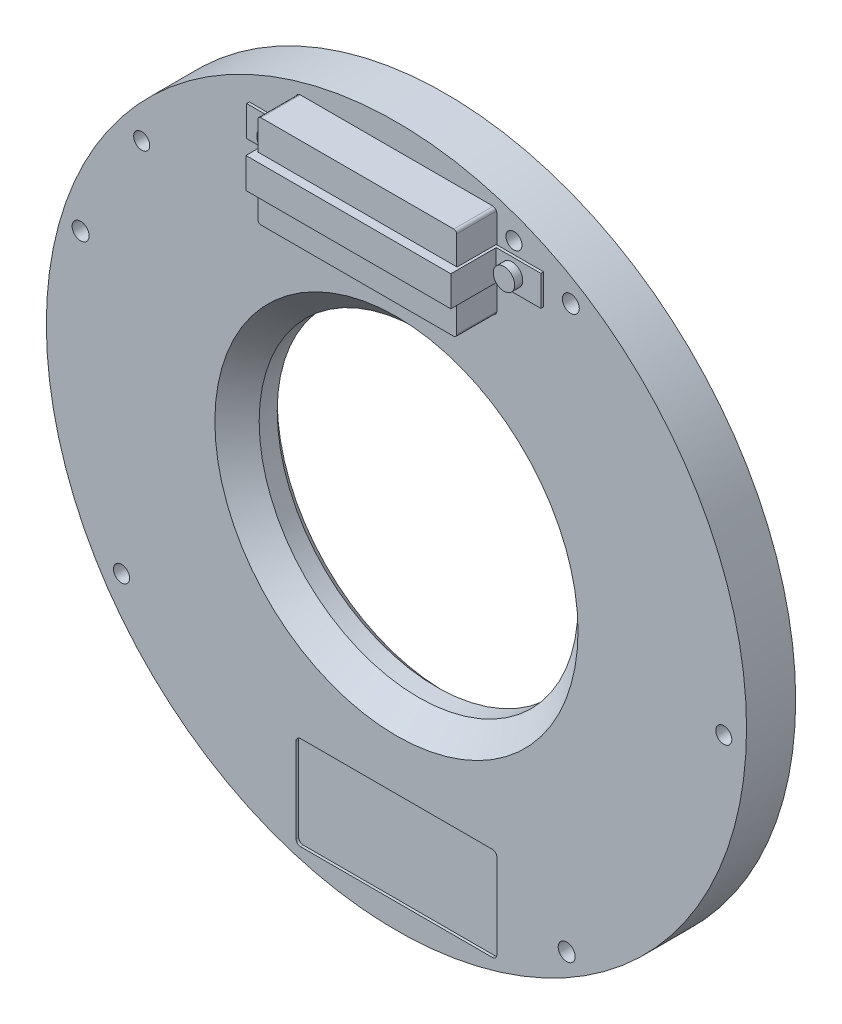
ISO-10303-21;
HEADER;
FILE_DESCRIPTION(('STEP AP214'),'2;1');
FILE_NAME('part.step','',(''),(''),'','','');
FILE_SCHEMA(('AUTOMOTIVE_DESIGN { 1 0 10303 214 1 1 1 1 }'));
ENDSEC;
DATA;
#1=APPLICATION_CONTEXT('core data for automotive mechanical design processes');
#2=APPLICATION_PROTOCOL_DEFINITION('international standard','automotive_design',2000,#1);
#3=PRODUCT_CONTEXT('',#1,'mechanical');
#4=PRODUCT('Part','Part','',(#3));
#5=PRODUCT_RELATED_PRODUCT_CATEGORY('part','',(#4));
#6=PRODUCT_DEFINITION_FORMATION('','',#4);
#7=PRODUCT_DEFINITION_CONTEXT('part definition',#1,'design');
#8=PRODUCT_DEFINITION('design','',#6,#7);
#9=PRODUCT_DEFINITION_SHAPE('','',#8);
#10=(LENGTH_UNIT() NAMED_UNIT(*) SI_UNIT(.MILLI.,.METRE.));
#11=(NAMED_UNIT(*) PLANE_ANGLE_UNIT() SI_UNIT($,.RADIAN.));
#12=(NAMED_UNIT(*) SI_UNIT($,.STERADIAN.) SOLID_ANGLE_UNIT());
#13=UNCERTAINTY_MEASURE_WITH_UNIT(LENGTH_MEASURE(1.E-05),#10,'distance_accuracy_value','');
#14=(GEOMETRIC_REPRESENTATION_CONTEXT(3) GLOBAL_UNCERTAINTY_ASSIGNED_CONTEXT((#13)) GLOBAL_UNIT_ASSIGNED_CONTEXT((#10,
#11,#12)) REPRESENTATION_CONTEXT('',''));
#15=CARTESIAN_POINT('',(0.,0.,0.));
#16=DIRECTION('',(0.,0.,1.));
#17=DIRECTION('',(1.,0.,0.));
#18=AXIS2_PLACEMENT_3D('',#15,#16,#17);
#19=CARTESIAN_POINT('',(0.,0.,1.27));
#20=DIRECTION('',(0.,0.,-1.));
#21=DIRECTION('',(-1.,0.,0.));
#22=AXIS2_PLACEMENT_3D('',#19,#20,#21);
#23=CONICAL_SURFACE('',#22,22.6695,0.785398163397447);
#24=CARTESIAN_POINT('',(0.,0.,0.));
#25=DIRECTION('',(0.,0.,-1.));
#26=DIRECTION('',(-1.,0.,0.));
#27=AXIS2_PLACEMENT_3D('',#24,#25,#26);
#28=CIRCLE('',#27,23.9395);
#29=CARTESIAN_POINT('',(-23.9395,0.,0.));
#30=VERTEX_POINT('',#29);
#31=EDGE_CURVE('E484',#30,#30,#28,.T.);
#32=ORIENTED_EDGE('',*,*,#31,.T.);
#33=EDGE_LOOP('',(#32));
#34=FACE_BOUND('',#33,.T.);
#35=CARTESIAN_POINT('',(0.,0.,1.27));
#36=DIRECTION('',(0.,0.,-1.));
#37=DIRECTION('',(-1.,0.,0.));
#38=AXIS2_PLACEMENT_3D('',#35,#36,#37);
#39=CIRCLE('',#38,22.6695);
#40=CARTESIAN_POINT('',(-22.6695,0.,1.27));
#41=VERTEX_POINT('',#40);
#42=EDGE_CURVE('E482',#41,#41,#39,.T.);
#43=ORIENTED_EDGE('',*,*,#42,.F.);
#44=EDGE_LOOP('',(#43));
#45=FACE_BOUND('',#44,.T.);
#46=ADVANCED_FACE('F14',(#34,#45),#23,.F.);
#47=CARTESIAN_POINT('',(13.716,33.4264,12.5476));
#48=DIRECTION('',(0.,0.,-1.));
#49=DIRECTION('',(0.,1.,0.));
#50=AXIS2_PLACEMENT_3D('',#47,#48,#49);
#51=CYLINDRICAL_SURFACE('',#50,0.406400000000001);
#52=DIRECTION('',(0.,0.,1.));
#53=VECTOR('',#52,1.);
#54=CARTESIAN_POINT('',(14.1224,33.4264,9.5758));
#55=LINE('',#54,#53);
#56=CARTESIAN_POINT('',(14.1224,33.4264,6.604));
#57=VERTEX_POINT('',#56);
#58=CARTESIAN_POINT('',(14.1224,33.4264,12.5476));
#59=VERTEX_POINT('',#58);
#60=EDGE_CURVE('E283',#57,#59,#55,.T.);
#61=ORIENTED_EDGE('',*,*,#60,.T.);
#62=CARTESIAN_POINT('',(13.716,33.4264,12.5476));
#63=DIRECTION('',(0.,0.,-1.));
#64=DIRECTION('',(0.,1.,0.));
#65=AXIS2_PLACEMENT_3D('',#62,#63,#64);
#66=CIRCLE('',#65,0.406400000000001);
#67=CARTESIAN_POINT('',(13.716,33.02,12.5476));
#68=VERTEX_POINT('',#67);
#69=EDGE_CURVE('E18',#68,#59,#66,.F.);
#70=ORIENTED_EDGE('',*,*,#69,.F.);
#71=DIRECTION('',(0.,0.,-1.));
#72=VECTOR('',#71,1.);
#73=CARTESIAN_POINT('',(13.716,33.02,9.5758));
#74=LINE('',#73,#72);
#75=CARTESIAN_POINT('',(13.716,33.02,6.604));
#76=VERTEX_POINT('',#75);
#77=EDGE_CURVE('E420',#68,#76,#74,.T.);
#78=ORIENTED_EDGE('',*,*,#77,.T.);
#79=CARTESIAN_POINT('',(13.716,33.4264,6.604));
#80=DIRECTION('',(0.,0.,-1.));
#81=DIRECTION('',(0.,1.,0.));
#82=AXIS2_PLACEMENT_3D('',#79,#80,#81);
#83=CIRCLE('',#82,0.406400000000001);
#84=EDGE_CURVE('E286',#57,#76,#83,.T.);
#85=ORIENTED_EDGE('',*,*,#84,.F.);
#86=EDGE_LOOP('',(#61,#70,#78,#85));
#87=FACE_BOUND('',#86,.T.);
#88=ADVANCED_FACE('F284',(#87),#51,.T.);
#89=CARTESIAN_POINT('',(13.716,45.8216,12.5476));
#90=DIRECTION('',(0.,0.,-1.));
#91=DIRECTION('',(0.,1.,0.));
#92=AXIS2_PLACEMENT_3D('',#89,#90,#91);
#93=CYLINDRICAL_SURFACE('',#92,0.406400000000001);
#94=DIRECTION('',(0.,0.,1.));
#95=VECTOR('',#94,1.);
#96=CARTESIAN_POINT('',(13.716,46.228,9.5758));
#97=LINE('',#96,#95);
#98=CARTESIAN_POINT('',(13.716,46.228,6.604));
#99=VERTEX_POINT('',#98);
#100=CARTESIAN_POINT('',(13.716,46.228,12.5476));
#101=VERTEX_POINT('',#100);
#102=EDGE_CURVE('E408',#99,#101,#97,.T.);
#103=ORIENTED_EDGE('',*,*,#102,.T.);
#104=CARTESIAN_POINT('',(13.716,45.8216,12.5476));
#105=DIRECTION('',(0.,0.,-1.));
#106=DIRECTION('',(0.,1.,0.));
#107=AXIS2_PLACEMENT_3D('',#104,#105,#106);
#108=CIRCLE('',#107,0.406400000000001);
#109=CARTESIAN_POINT('',(14.1224,45.8216,12.5476));
#110=VERTEX_POINT('',#109);
#111=EDGE_CURVE('E281',#110,#101,#108,.F.);
#112=ORIENTED_EDGE('',*,*,#111,.F.);
#113=DIRECTION('',(0.,0.,-1.));
#114=VECTOR('',#113,1.);
#115=CARTESIAN_POINT('',(14.1224,45.8216,9.5758));
#116=LINE('',#115,#114);
#117=CARTESIAN_POINT('',(14.1224,45.8216,6.604));
#118=VERTEX_POINT('',#117);
#119=EDGE_CURVE('E290',#110,#118,#116,.T.);
#120=ORIENTED_EDGE('',*,*,#119,.T.);
#121=CARTESIAN_POINT('',(13.716,45.8216,6.604));
#122=DIRECTION('',(0.,0.,-1.));
#123=DIRECTION('',(0.,1.,0.));
#124=AXIS2_PLACEMENT_3D('',#121,#122,#123);
#125=CIRCLE('',#124,0.406400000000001);
#126=EDGE_CURVE('E598',#99,#118,#125,.T.);
#127=ORIENTED_EDGE('',*,*,#126,.F.);
#128=EDGE_LOOP('',(#103,#112,#120,#127));
#129=FACE_BOUND('',#128,.T.);
#130=ADVANCED_FACE('F616',(#129),#93,.T.);
#131=CARTESIAN_POINT('',(-13.716,45.8216,12.5476));
#132=DIRECTION('',(0.,0.,-1.));
#133=DIRECTION('',(0.,1.,0.));
#134=AXIS2_PLACEMENT_3D('',#131,#132,#133);
#135=CYLINDRICAL_SURFACE('',#134,0.406399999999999);
#136=DIRECTION('',(0.,0.,1.));
#137=VECTOR('',#136,1.);
#138=CARTESIAN_POINT('',(-14.1224,45.8216,9.5758));
#139=LINE('',#138,#137);
#140=CARTESIAN_POINT('',(-14.1224,45.8216,6.604));
#141=VERTEX_POINT('',#140);
#142=CARTESIAN_POINT('',(-14.1224,45.8216,12.5476));
#143=VERTEX_POINT('',#142);
#144=EDGE_CURVE('E397',#141,#143,#139,.T.);
#145=ORIENTED_EDGE('',*,*,#144,.T.);
#146=CARTESIAN_POINT('',(-13.716,45.8216,12.5476));
#147=DIRECTION('',(0.,0.,-1.));
#148=DIRECTION('',(0.,1.,0.));
#149=AXIS2_PLACEMENT_3D('',#146,#147,#148);
#150=CIRCLE('',#149,0.406399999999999);
#151=CARTESIAN_POINT('',(-13.716,46.228,12.5476));
#152=VERTEX_POINT('',#151);
#153=EDGE_CURVE('E607',#152,#143,#150,.F.);
#154=ORIENTED_EDGE('',*,*,#153,.F.);
#155=DIRECTION('',(0.,0.,-1.));
#156=VECTOR('',#155,1.);
#157=CARTESIAN_POINT('',(-13.716,46.228,9.5758));
#158=LINE('',#157,#156);
#159=CARTESIAN_POINT('',(-13.716,46.228,6.604));
#160=VERTEX_POINT('',#159);
#161=EDGE_CURVE('E411',#152,#160,#158,.T.);
#162=ORIENTED_EDGE('',*,*,#161,.T.);
#163=CARTESIAN_POINT('',(-13.716,45.8216,6.604));
#164=DIRECTION('',(0.,0.,-1.));
#165=DIRECTION('',(0.,1.,0.));
#166=AXIS2_PLACEMENT_3D('',#163,#164,#165);
#167=CIRCLE('',#166,0.406399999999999);
#168=EDGE_CURVE('E601',#141,#160,#167,.T.);
#169=ORIENTED_EDGE('',*,*,#168,.F.);
#170=EDGE_LOOP('',(#145,#154,#162,#169));
#171=FACE_BOUND('',#170,.T.);
#172=ADVANCED_FACE('F847',(#171),#135,.T.);
#173=CARTESIAN_POINT('',(-13.716,33.4264,12.5476));
#174=DIRECTION('',(0.,0.,-1.));
#175=DIRECTION('',(0.,1.,0.));
#176=AXIS2_PLACEMENT_3D('',#173,#174,#175);
#177=CYLINDRICAL_SURFACE('',#176,0.406399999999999);
#178=DIRECTION('',(0.,0.,1.));
#179=VECTOR('',#178,1.);
#180=CARTESIAN_POINT('',(-13.716,33.02,9.5758));
#181=LINE('',#180,#179);
#182=CARTESIAN_POINT('',(-13.716,33.02,6.604));
#183=VERTEX_POINT('',#182);
#184=CARTESIAN_POINT('',(-13.716,33.02,12.5476));
#185=VERTEX_POINT('',#184);
#186=EDGE_CURVE('E417',#183,#185,#181,.T.);
#187=ORIENTED_EDGE('',*,*,#186,.T.);
#188=CARTESIAN_POINT('',(-13.716,33.4264,12.5476));
#189=DIRECTION('',(0.,0.,-1.));
#190=DIRECTION('',(0.,1.,0.));
#191=AXIS2_PLACEMENT_3D('',#188,#189,#190);
#192=CIRCLE('',#191,0.406399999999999);
#193=CARTESIAN_POINT('',(-14.1224,33.4264,12.5476));
#194=VERTEX_POINT('',#193);
#195=EDGE_CURVE('E485',#194,#185,#192,.F.);
#196=ORIENTED_EDGE('',*,*,#195,.F.);
#197=DIRECTION('',(0.,0.,-1.));
#198=VECTOR('',#197,1.);
#199=CARTESIAN_POINT('',(-14.1224,33.4264,9.5758));
#200=LINE('',#199,#198);
#201=CARTESIAN_POINT('',(-14.1224,33.4264,6.604));
#202=VERTEX_POINT('',#201);
#203=EDGE_CURVE('E404',#194,#202,#200,.T.);
#204=ORIENTED_EDGE('',*,*,#203,.T.);
#205=CARTESIAN_POINT('',(-13.716,33.4264,6.604));
#206=DIRECTION('',(0.,0.,-1.));
#207=DIRECTION('',(0.,1.,0.));
#208=AXIS2_PLACEMENT_3D('',#205,#206,#207);
#209=CIRCLE('',#208,0.406399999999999);
#210=EDGE_CURVE('E421',#183,#202,#209,.T.);
#211=ORIENTED_EDGE('',*,*,#210,.F.);
#212=EDGE_LOOP('',(#187,#196,#204,#211));
#213=FACE_BOUND('',#212,.T.);
#214=ADVANCED_FACE('F727',(#213),#177,.T.);
#215=CARTESIAN_POINT('',(0.,0.,3.8354));
#216=DIRECTION('',(0.,0.,-1.));
#217=DIRECTION('',(-1.,0.,0.));
#218=AXIS2_PLACEMENT_3D('',#215,#216,#217);
#219=CYLINDRICAL_SURFACE('',#218,22.6695);
#220=CARTESIAN_POINT('',(0.,0.,3.83540000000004));
#221=DIRECTION('',(0.,0.,1.));
#222=DIRECTION('',(1.,0.,0.));
#223=AXIS2_PLACEMENT_3D('',#220,#221,#222);
#224=CIRCLE('',#223,22.6695);
#225=CARTESIAN_POINT('',(22.6695,0.,3.8354));
#226=VERTEX_POINT('',#225);
#227=EDGE_CURVE('E443',#226,#226,#224,.F.);
#228=ORIENTED_EDGE('',*,*,#227,.F.);
#229=EDGE_LOOP('',(#228));
#230=FACE_BOUND('',#229,.T.);
#231=ORIENTED_EDGE('',*,*,#42,.T.);
#232=EDGE_LOOP('',(#231));
#233=FACE_BOUND('',#232,.T.);
#234=ADVANCED_FACE('F840',(#230,#233),#219,.F.);
#235=CARTESIAN_POINT('',(-50.381408,-50.381408,0.));
#236=DIRECTION('',(0.,0.,1.));
#237=DIRECTION('',(1.,0.,0.));
#238=AXIS2_PLACEMENT_3D('',#235,#236,#237);
#239=PLANE('',#238);
#240=CARTESIAN_POINT('',(-44.9072,13.8938,0.));
#241=DIRECTION('',(0.,0.,-1.));
#242=DIRECTION('',(-1.,0.,0.));
#243=AXIS2_PLACEMENT_3D('',#240,#241,#242);
#244=CIRCLE('',#243,1.20649999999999);
#245=CARTESIAN_POINT('',(-46.1137,13.8938,0.));
#246=VERTEX_POINT('',#245);
#247=EDGE_CURVE('E574',#246,#246,#244,.T.);
#248=ORIENTED_EDGE('',*,*,#247,.F.);
#249=EDGE_LOOP('',(#248));
#250=FACE_BOUND('',#249,.T.);
#251=CARTESIAN_POINT('',(24.2062,-40.3098,0.));
#252=DIRECTION('',(0.,0.,-1.));
#253=DIRECTION('',(-1.,0.,0.));
#254=AXIS2_PLACEMENT_3D('',#251,#252,#253);
#255=CIRCLE('',#254,1.2065);
#256=CARTESIAN_POINT('',(22.9997,-40.3098,0.));
#257=VERTEX_POINT('',#256);
#258=EDGE_CURVE('E577',#257,#257,#255,.T.);
#259=ORIENTED_EDGE('',*,*,#258,.F.);
#260=EDGE_LOOP('',(#259));
#261=FACE_BOUND('',#260,.T.);
#262=CARTESIAN_POINT('',(24.7904,39.8018,0.));
#263=DIRECTION('',(0.,0.,-1.));
#264=DIRECTION('',(-1.,0.,0.));
#265=AXIS2_PLACEMENT_3D('',#262,#263,#264);
#266=CIRCLE('',#265,1.2065);
#267=CARTESIAN_POINT('',(23.5839,39.8018,0.));
#268=VERTEX_POINT('',#267);
#269=EDGE_CURVE('E446',#268,#268,#266,.T.);
#270=ORIENTED_EDGE('',*,*,#269,.F.);
#271=EDGE_LOOP('',(#270));
#272=FACE_BOUND('',#271,.T.);
#273=ORIENTED_EDGE('',*,*,#31,.F.);
#274=EDGE_LOOP('',(#273));
#275=FACE_BOUND('',#274,.T.);
#276=CARTESIAN_POINT('',(46.5451239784,-2.439326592,0.));
#277=DIRECTION('',(0.,0.,-1.));
#278=DIRECTION('',(-1.,0.,0.));
#279=AXIS2_PLACEMENT_3D('',#276,#277,#278);
#280=CIRCLE('',#279,1.143);
#281=CARTESIAN_POINT('',(45.4021239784,-2.439326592,0.));
#282=VERTEX_POINT('',#281);
#283=EDGE_CURVE('E447',#282,#282,#280,.T.);
#284=ORIENTED_EDGE('',*,*,#283,.F.);
#285=EDGE_LOOP('',(#284));
#286=FACE_BOUND('',#285,.T.);
#287=CARTESIAN_POINT('',(16.7031717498,43.5132501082,0.));
#288=DIRECTION('',(0.,0.,-1.));
#289=DIRECTION('',(-1.,0.,0.));
#290=AXIS2_PLACEMENT_3D('',#287,#288,#289);
#291=CIRCLE('',#290,1.143);
#292=CARTESIAN_POINT('',(15.5601717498,43.5132501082,0.));
#293=VERTEX_POINT('',#292);
#294=EDGE_CURVE('E584',#293,#293,#291,.T.);
#295=ORIENTED_EDGE('',*,*,#294,.F.);
#296=EDGE_LOOP('',(#295));
#297=FACE_BOUND('',#296,.T.);
#298=CARTESIAN_POINT('',(-36.2219961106,29.3319941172,0.));
#299=DIRECTION('',(0.,0.,-1.));
#300=DIRECTION('',(-1.,0.,0.));
#301=AXIS2_PLACEMENT_3D('',#298,#299,#300);
#302=CIRCLE('',#301,1.143);
#303=CARTESIAN_POINT('',(-37.3649961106,29.3319941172,0.));
#304=VERTEX_POINT('',#303);
#305=EDGE_CURVE('E587',#304,#304,#302,.T.);
#306=ORIENTED_EDGE('',*,*,#305,.F.);
#307=EDGE_LOOP('',(#306));
#308=FACE_BOUND('',#307,.T.);
#309=CARTESIAN_POINT('',(-39.0895964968,-25.3850807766,0.));
#310=DIRECTION('',(0.,0.,-1.));
#311=DIRECTION('',(-1.,0.,0.));
#312=AXIS2_PLACEMENT_3D('',#309,#310,#311);
#313=CIRCLE('',#312,1.143);
#314=CARTESIAN_POINT('',(-40.2325964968,-25.3850807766,0.));
#315=VERTEX_POINT('',#314);
#316=EDGE_CURVE('E590',#315,#315,#313,.T.);
#317=ORIENTED_EDGE('',*,*,#316,.F.);
#318=EDGE_LOOP('',(#317));
#319=FACE_BOUND('',#318,.T.);
#320=CARTESIAN_POINT('',(0.,0.,0.));
#321=DIRECTION('',(0.,0.,-1.));
#322=DIRECTION('',(-1.,0.,0.));
#323=AXIS2_PLACEMENT_3D('',#320,#321,#322);
#324=CIRCLE('',#323,49.784);
#325=CARTESIAN_POINT('',(-49.784,0.,0.));
#326=VERTEX_POINT('',#325);
#327=EDGE_CURVE('E452',#326,#326,#324,.T.);
#328=ORIENTED_EDGE('',*,*,#327,.T.);
#329=EDGE_LOOP('',(#328));
#330=FACE_BOUND('',#329,.T.);
#331=ADVANCED_FACE('F843',(#250,#261,#272,#275,#286,#297,#308,#319,#330),#239,.F.);
#332=CARTESIAN_POINT('',(-14.2748,32.9692,6.604));
#333=DIRECTION('',(0.,0.,1.));
#334=DIRECTION('',(1.,0.,0.));
#335=AXIS2_PLACEMENT_3D('',#332,#333,#334);
#336=PLANE('',#335);
#337=DIRECTION('',(-1.,0.,0.));
#338=VECTOR('',#337,1.);
#339=CARTESIAN_POINT('',(0.,33.02,6.604));
#340=LINE('',#339,#338);
#341=EDGE_CURVE('E423',#76,#183,#340,.T.);
#342=ORIENTED_EDGE('',*,*,#341,.T.);
#343=ORIENTED_EDGE('',*,*,#210,.T.);
#344=DIRECTION('',(0.,1.,0.));
#345=VECTOR('',#344,1.);
#346=CARTESIAN_POINT('',(-14.1224,39.624,6.604));
#347=LINE('',#346,#345);
#348=EDGE_CURVE('E425',#202,#141,#347,.T.);
#349=ORIENTED_EDGE('',*,*,#348,.T.);
#350=ORIENTED_EDGE('',*,*,#168,.T.);
#351=DIRECTION('',(1.,0.,0.));
#352=VECTOR('',#351,1.);
#353=CARTESIAN_POINT('',(0.,46.228,6.604));
#354=LINE('',#353,#352);
#355=EDGE_CURVE('E401',#160,#99,#354,.T.);
#356=ORIENTED_EDGE('',*,*,#355,.T.);
#357=ORIENTED_EDGE('',*,*,#126,.T.);
#358=DIRECTION('',(0.,-1.,0.));
#359=VECTOR('',#358,1.);
#360=CARTESIAN_POINT('',(14.1224,39.624,6.604));
#361=LINE('',#360,#359);
#362=EDGE_CURVE('E412',#118,#57,#361,.T.);
#363=ORIENTED_EDGE('',*,*,#362,.T.);
#364=ORIENTED_EDGE('',*,*,#84,.T.);
#365=EDGE_LOOP('',(#342,#343,#349,#350,#356,#357,#363,#364));
#366=FACE_BOUND('',#365,.T.);
#367=CARTESIAN_POINT('',(13.6398,45.6438,6.604));
#368=DIRECTION('',(0.,0.,1.));
#369=DIRECTION('',(1.,0.,0.));
#370=AXIS2_PLACEMENT_3D('',#367,#368,#369);
#371=CIRCLE('',#370,0.635);
#372=CARTESIAN_POINT('',(13.6397999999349,46.2788,6.604));
#373=VERTEX_POINT('',#372);
#374=CARTESIAN_POINT('',(14.2748,45.6438,6.604));
#375=VERTEX_POINT('',#374);
#376=EDGE_CURVE('E359',#373,#375,#371,.F.);
#377=ORIENTED_EDGE('',*,*,#376,.F.);
#378=DIRECTION('',(-1.,0.,0.));
#379=VECTOR('',#378,1.);
#380=CARTESIAN_POINT('',(0.,46.2788,6.604));
#381=LINE('',#380,#379);
#382=CARTESIAN_POINT('',(-13.6398,46.2788,6.604));
#383=VERTEX_POINT('',#382);
#384=EDGE_CURVE('E362',#373,#383,#381,.T.);
#385=ORIENTED_EDGE('',*,*,#384,.T.);
#386=CARTESIAN_POINT('',(-13.6398,45.6438,6.604));
#387=DIRECTION('',(0.,0.,1.));
#388=DIRECTION('',(1.,0.,0.));
#389=AXIS2_PLACEMENT_3D('',#386,#387,#388);
#390=CIRCLE('',#389,0.635);
#391=CARTESIAN_POINT('',(-14.2748,45.6437999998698,6.604));
#392=VERTEX_POINT('',#391);
#393=EDGE_CURVE('E366',#392,#383,#390,.F.);
#394=ORIENTED_EDGE('',*,*,#393,.F.);
#395=DIRECTION('',(0.,-1.,0.));
#396=VECTOR('',#395,1.);
#397=CARTESIAN_POINT('',(-14.2748,39.624,6.604));
#398=LINE('',#397,#396);
#399=CARTESIAN_POINT('',(-14.2748,33.6042,6.604));
#400=VERTEX_POINT('',#399);
#401=EDGE_CURVE('E377',#392,#400,#398,.T.);
#402=ORIENTED_EDGE('',*,*,#401,.T.);
#403=CARTESIAN_POINT('',(-13.6398,33.6042,6.604));
#404=DIRECTION('',(0.,0.,1.));
#405=DIRECTION('',(1.,0.,0.));
#406=AXIS2_PLACEMENT_3D('',#403,#404,#405);
#407=CIRCLE('',#406,0.635);
#408=CARTESIAN_POINT('',(-13.6398000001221,32.9692,6.604));
#409=VERTEX_POINT('',#408);
#410=EDGE_CURVE('E385',#409,#400,#407,.F.);
#411=ORIENTED_EDGE('',*,*,#410,.F.);
#412=DIRECTION('',(1.,0.,0.));
#413=VECTOR('',#412,1.);
#414=CARTESIAN_POINT('',(0.,32.9692,6.604));
#415=LINE('',#414,#413);
#416=CARTESIAN_POINT('',(13.6398,32.9692,6.604));
#417=VERTEX_POINT('',#416);
#418=EDGE_CURVE('E388',#409,#417,#415,.T.);
#419=ORIENTED_EDGE('',*,*,#418,.T.);
#420=CARTESIAN_POINT('',(13.6398,33.6042,6.604));
#421=DIRECTION('',(0.,0.,1.));
#422=DIRECTION('',(1.,0.,0.));
#423=AXIS2_PLACEMENT_3D('',#420,#421,#422);
#424=CIRCLE('',#423,0.635);
#425=CARTESIAN_POINT('',(14.2748,33.6042,6.604));
#426=VERTEX_POINT('',#425);
#427=EDGE_CURVE('E442',#426,#417,#424,.F.);
#428=ORIENTED_EDGE('',*,*,#427,.F.);
#429=DIRECTION('',(0.,1.,0.));
#430=VECTOR('',#429,1.);
#431=CARTESIAN_POINT('',(14.2748,39.624,6.604));
#432=LINE('',#431,#430);
#433=EDGE_CURVE('E347',#426,#375,#432,.T.);
#434=ORIENTED_EDGE('',*,*,#433,.T.);
#435=EDGE_LOOP('',(#377,#385,#394,#402,#411,#419,#428,#434));
#436=FACE_BOUND('',#435,.T.);
#437=ADVANCED_FACE('F729',(#366,#436),#336,.T.);
#438=CARTESIAN_POINT('',(14.2748,-32.9692,6.604));
#439=DIRECTION('',(0.,0.,1.));
#440=DIRECTION('',(-1.,0.,0.));
#441=AXIS2_PLACEMENT_3D('',#438,#439,#440);
#442=PLANE('',#441);
#443=CARTESIAN_POINT('',(-13.6398,-45.6438,6.604));
#444=DIRECTION('',(0.,0.,1.));
#445=DIRECTION('',(1.,0.,0.));
#446=AXIS2_PLACEMENT_3D('',#443,#444,#445);
#447=CIRCLE('',#446,0.635);
#448=CARTESIAN_POINT('',(-13.6398000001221,-46.2788,6.604));
#449=VERTEX_POINT('',#448);
#450=CARTESIAN_POINT('',(-14.2748,-45.6438,6.604));
#451=VERTEX_POINT('',#450);
#452=EDGE_CURVE('E340',#449,#451,#447,.F.);
#453=ORIENTED_EDGE('',*,*,#452,.F.);
#454=DIRECTION('',(1.,0.,0.));
#455=VECTOR('',#454,1.);
#456=CARTESIAN_POINT('',(0.,-46.2788,6.604));
#457=LINE('',#456,#455);
#458=CARTESIAN_POINT('',(13.6398,-46.2788,6.604));
#459=VERTEX_POINT('',#458);
#460=EDGE_CURVE('E343',#449,#459,#457,.T.);
#461=ORIENTED_EDGE('',*,*,#460,.T.);
#462=CARTESIAN_POINT('',(13.6398,-45.6438,6.604));
#463=DIRECTION('',(0.,0.,1.));
#464=DIRECTION('',(1.,0.,0.));
#465=AXIS2_PLACEMENT_3D('',#462,#463,#464);
#466=CIRCLE('',#465,0.635);
#467=CARTESIAN_POINT('',(14.2748,-45.6438,6.604));
#468=VERTEX_POINT('',#467);
#469=EDGE_CURVE('E350',#468,#459,#466,.F.);
#470=ORIENTED_EDGE('',*,*,#469,.F.);
#471=DIRECTION('',(0.,1.,0.));
#472=VECTOR('',#471,1.);
#473=CARTESIAN_POINT('',(14.2748,-39.624,6.604));
#474=LINE('',#473,#472);
#475=CARTESIAN_POINT('',(14.2748,-33.6042,6.604));
#476=VERTEX_POINT('',#475);
#477=EDGE_CURVE('E319',#468,#476,#474,.T.);
#478=ORIENTED_EDGE('',*,*,#477,.T.);
#479=CARTESIAN_POINT('',(13.6398,-33.6042,6.604));
#480=DIRECTION('',(0.,0.,1.));
#481=DIRECTION('',(1.,0.,0.));
#482=AXIS2_PLACEMENT_3D('',#479,#480,#481);
#483=CIRCLE('',#482,0.635);
#484=CARTESIAN_POINT('',(13.6397999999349,-32.9692,6.604));
#485=VERTEX_POINT('',#484);
#486=EDGE_CURVE('E323',#485,#476,#483,.F.);
#487=ORIENTED_EDGE('',*,*,#486,.F.);
#488=DIRECTION('',(-1.,0.,0.));
#489=VECTOR('',#488,1.);
#490=CARTESIAN_POINT('',(0.,-32.9692,6.604));
#491=LINE('',#490,#489);
#492=CARTESIAN_POINT('',(-13.6398,-32.9692,6.604));
#493=VERTEX_POINT('',#492);
#494=EDGE_CURVE('E329',#485,#493,#491,.T.);
#495=ORIENTED_EDGE('',*,*,#494,.T.);
#496=CARTESIAN_POINT('',(-13.6398,-33.6042,6.604));
#497=DIRECTION('',(0.,0.,1.));
#498=DIRECTION('',(1.,0.,0.));
#499=AXIS2_PLACEMENT_3D('',#496,#497,#498);
#500=CIRCLE('',#499,0.635);
#501=CARTESIAN_POINT('',(-14.2748,-33.6042000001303,6.604));
#502=VERTEX_POINT('',#501);
#503=EDGE_CURVE('E333',#502,#493,#500,.F.);
#504=ORIENTED_EDGE('',*,*,#503,.F.);
#505=DIRECTION('',(0.,-1.,0.));
#506=VECTOR('',#505,1.);
#507=CARTESIAN_POINT('',(-14.2748,-39.624,6.604));
#508=LINE('',#507,#506);
#509=EDGE_CURVE('E336',#502,#451,#508,.T.);
#510=ORIENTED_EDGE('',*,*,#509,.T.);
#511=EDGE_LOOP('',(#453,#461,#470,#478,#487,#495,#504,#510));
#512=FACE_BOUND('',#511,.T.);
#513=ADVANCED_FACE('F744',(#512),#442,.T.);
#514=CARTESIAN_POINT('',(15.272512,38.081712,8.509));
#515=DIRECTION('',(0.,0.,1.));
#516=DIRECTION('',(1.,0.,0.));
#517=AXIS2_PLACEMENT_3D('',#514,#515,#516);
#518=PLANE('',#517);
#519=CARTESIAN_POINT('',(16.8148,39.624,8.509));
#520=DIRECTION('',(0.,0.,-1.));
#521=DIRECTION('',(-1.,0.,0.));
#522=AXIS2_PLACEMENT_3D('',#519,#520,#521);
#523=CIRCLE('',#522,1.524);
#524=CARTESIAN_POINT('',(15.2908,39.624,8.509));
#525=VERTEX_POINT('',#524);
#526=EDGE_CURVE('E312',#525,#525,#523,.F.);
#527=ORIENTED_EDGE('',*,*,#526,.T.);
#528=EDGE_LOOP('',(#527));
#529=FACE_BOUND('',#528,.T.);
#530=ADVANCED_FACE('F736',(#529),#518,.T.);
#531=CARTESIAN_POINT('',(-13.716,33.02,6.604));
#532=DIRECTION('',(0.,1.,0.));
#533=DIRECTION('',(0.,0.,1.));
#534=AXIS2_PLACEMENT_3D('',#531,#532,#533);
#535=PLANE('',#534);
#536=ORIENTED_EDGE('',*,*,#77,.F.);
#537=DIRECTION('',(1.,0.,0.));
#538=VECTOR('',#537,1.);
#539=CARTESIAN_POINT('',(0.,33.02,12.5476));
#540=LINE('',#539,#538);
#541=EDGE_CURVE('E280',#185,#68,#540,.T.);
#542=ORIENTED_EDGE('',*,*,#541,.F.);
#543=ORIENTED_EDGE('',*,*,#186,.F.);
#544=ORIENTED_EDGE('',*,*,#341,.F.);
#545=EDGE_LOOP('',(#536,#542,#543,#544));
#546=FACE_BOUND('',#545,.T.);
#547=ADVANCED_FACE('F734',(#546),#535,.F.);
#548=CARTESIAN_POINT('',(-14.1859,37.465,12.5476));
#549=DIRECTION('',(0.,0.,1.));
#550=DIRECTION('',(1.,0.,0.));
#551=AXIS2_PLACEMENT_3D('',#548,#549,#550);
#552=PLANE('',#551);
#553=DIRECTION('',(-1.,0.,0.));
#554=VECTOR('',#553,1.);
#555=CARTESIAN_POINT('',(-14.15415,41.783,12.5476));
#556=LINE('',#555,#554);
#557=CARTESIAN_POINT('',(-14.1224,41.783,12.5475999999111));
#558=VERTEX_POINT('',#557);
#559=CARTESIAN_POINT('',(-14.1858999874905,41.783,12.5475999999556));
#560=VERTEX_POINT('',#559);
#561=EDGE_CURVE('E439',#558,#560,#556,.T.);
#562=ORIENTED_EDGE('',*,*,#561,.F.);
#563=DIRECTION('',(0.,-1.,0.));
#564=VECTOR('',#563,1.);
#565=CARTESIAN_POINT('',(-14.1224,39.624,12.5476));
#566=LINE('',#565,#564);
#567=CARTESIAN_POINT('',(-14.1223999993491,37.4649999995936,12.5475999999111));
#568=VERTEX_POINT('',#567);
#569=EDGE_CURVE('E400',#558,#568,#566,.T.);
#570=ORIENTED_EDGE('',*,*,#569,.T.);
#571=DIRECTION('',(1.,0.,0.));
#572=VECTOR('',#571,1.);
#573=CARTESIAN_POINT('',(-14.15415,37.465,12.5476));
#574=LINE('',#573,#572);
#575=CARTESIAN_POINT('',(-14.1858999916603,37.465,12.5475999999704));
#576=VERTEX_POINT('',#575);
#577=EDGE_CURVE('E469',#576,#568,#574,.T.);
#578=ORIENTED_EDGE('',*,*,#577,.F.);
#579=DIRECTION('',(0.,1.,0.));
#580=VECTOR('',#579,1.);
#581=CARTESIAN_POINT('',(-14.1859,39.624,12.5476));
#582=LINE('',#581,#580);
#583=EDGE_CURVE('E299',#576,#560,#582,.T.);
#584=ORIENTED_EDGE('',*,*,#583,.T.);
#585=EDGE_LOOP('',(#562,#570,#578,#584));
#586=FACE_BOUND('',#585,.T.);
#587=ADVANCED_FACE('F715',(#586),#552,.F.);
#588=CARTESIAN_POINT('',(-14.2748,37.465,6.985));
#589=DIRECTION('',(0.,0.,1.));
#590=DIRECTION('',(1.,0.,0.));
#591=AXIS2_PLACEMENT_3D('',#588,#589,#590);
#592=PLANE('',#591);
#593=DIRECTION('',(-1.,0.,0.));
#594=VECTOR('',#593,1.);
#595=CARTESIAN_POINT('',(-14.23035,41.783,6.985));
#596=LINE('',#595,#594);
#597=CARTESIAN_POINT('',(-14.1858999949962,41.783,6.985));
#598=VERTEX_POINT('',#597);
#599=CARTESIAN_POINT('',(-14.2748000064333,41.7830000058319,6.985));
#600=VERTEX_POINT('',#599);
#601=EDGE_CURVE('E291',#598,#600,#596,.T.);
#602=ORIENTED_EDGE('',*,*,#601,.F.);
#603=DIRECTION('',(0.,-1.,0.));
#604=VECTOR('',#603,1.);
#605=CARTESIAN_POINT('',(-14.1859,39.624,6.985));
#606=LINE('',#605,#604);
#607=CARTESIAN_POINT('',(-14.1858999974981,37.465,6.985));
#608=VERTEX_POINT('',#607);
#609=EDGE_CURVE('E302',#598,#608,#606,.T.);
#610=ORIENTED_EDGE('',*,*,#609,.T.);
#611=DIRECTION('',(1.,0.,0.));
#612=VECTOR('',#611,1.);
#613=CARTESIAN_POINT('',(-14.23035,37.465,6.985));
#614=LINE('',#613,#612);
#615=CARTESIAN_POINT('',(-14.274800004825,37.464999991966,6.985));
#616=VERTEX_POINT('',#615);
#617=EDGE_CURVE('E437',#616,#608,#614,.T.);
#618=ORIENTED_EDGE('',*,*,#617,.F.);
#619=DIRECTION('',(0.,1.,0.));
#620=VECTOR('',#619,1.);
#621=CARTESIAN_POINT('',(-14.2748,39.624,6.985));
#622=LINE('',#621,#620);
#623=EDGE_CURVE('E367',#616,#600,#622,.T.);
#624=ORIENTED_EDGE('',*,*,#623,.T.);
#625=EDGE_LOOP('',(#602,#610,#618,#624));
#626=FACE_BOUND('',#625,.T.);
#627=ADVANCED_FACE('F709',(#626),#592,.F.);
#628=CARTESIAN_POINT('',(14.1224,33.4264,6.604));
#629=DIRECTION('',(-1.,0.,0.));
#630=DIRECTION('',(0.,0.,1.));
#631=AXIS2_PLACEMENT_3D('',#628,#629,#630);
#632=PLANE('',#631);
#633=ORIENTED_EDGE('',*,*,#119,.F.);
#634=DIRECTION('',(0.,1.,0.));
#635=VECTOR('',#634,1.);
#636=CARTESIAN_POINT('',(14.1224,44.0055,12.5476));
#637=LINE('',#636,#635);
#638=CARTESIAN_POINT('',(14.1223999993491,41.783,12.5475999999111));
#639=VERTEX_POINT('',#638);
#640=EDGE_CURVE('E307',#639,#110,#637,.T.);
#641=ORIENTED_EDGE('',*,*,#640,.F.);
#642=DIRECTION('',(0.,-1.,0.));
#643=VECTOR('',#642,1.);
#644=CARTESIAN_POINT('',(14.1224,39.624,12.5476));
#645=LINE('',#644,#643);
#646=CARTESIAN_POINT('',(14.1224,37.465,12.5475999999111));
#647=VERTEX_POINT('',#646);
#648=EDGE_CURVE('E297',#639,#647,#645,.T.);
#649=ORIENTED_EDGE('',*,*,#648,.T.);
#650=DIRECTION('',(0.,1.,0.));
#651=VECTOR('',#650,1.);
#652=CARTESIAN_POINT('',(14.1224,35.2425,12.5476));
#653=LINE('',#652,#651);
#654=EDGE_CURVE('E277',#59,#647,#653,.T.);
#655=ORIENTED_EDGE('',*,*,#654,.F.);
#656=ORIENTED_EDGE('',*,*,#60,.F.);
#657=ORIENTED_EDGE('',*,*,#362,.F.);
#658=EDGE_LOOP('',(#633,#641,#649,#655,#656,#657));
#659=FACE_BOUND('',#658,.T.);
#660=ADVANCED_FACE('F294',(#659),#632,.F.);
#661=CARTESIAN_POINT('',(-13.716,46.228,12.5476));
#662=DIRECTION('',(0.,-1.,0.));
#663=DIRECTION('',(0.,0.,-1.));
#664=AXIS2_PLACEMENT_3D('',#661,#662,#663);
#665=PLANE('',#664);
#666=ORIENTED_EDGE('',*,*,#161,.F.);
#667=DIRECTION('',(-1.,0.,0.));
#668=VECTOR('',#667,1.);
#669=CARTESIAN_POINT('',(0.,46.228,12.5476));
#670=LINE('',#669,#668);
#671=EDGE_CURVE('E613',#101,#152,#670,.T.);
#672=ORIENTED_EDGE('',*,*,#671,.F.);
#673=ORIENTED_EDGE('',*,*,#102,.F.);
#674=ORIENTED_EDGE('',*,*,#355,.F.);
#675=EDGE_LOOP('',(#666,#672,#673,#674));
#676=FACE_BOUND('',#675,.T.);
#677=ADVANCED_FACE('F620',(#676),#665,.F.);
#678=CARTESIAN_POINT('',(-14.1224,33.4264,12.5476));
#679=DIRECTION('',(1.,0.,0.));
#680=DIRECTION('',(0.,0.,-1.));
#681=AXIS2_PLACEMENT_3D('',#678,#679,#680);
#682=PLANE('',#681);
#683=ORIENTED_EDGE('',*,*,#203,.F.);
#684=DIRECTION('',(0.,-1.,0.));
#685=VECTOR('',#684,1.);
#686=CARTESIAN_POINT('',(-14.1224,35.2425,12.5476));
#687=LINE('',#686,#685);
#688=EDGE_CURVE('E304',#568,#194,#687,.T.);
#689=ORIENTED_EDGE('',*,*,#688,.F.);
#690=ORIENTED_EDGE('',*,*,#569,.F.);
#691=DIRECTION('',(0.,-1.,0.));
#692=VECTOR('',#691,1.);
#693=CARTESIAN_POINT('',(-14.1224,44.0055,12.5476));
#694=LINE('',#693,#692);
#695=EDGE_CURVE('E465',#143,#558,#694,.T.);
#696=ORIENTED_EDGE('',*,*,#695,.F.);
#697=ORIENTED_EDGE('',*,*,#144,.F.);
#698=ORIENTED_EDGE('',*,*,#348,.F.);
#699=EDGE_LOOP('',(#683,#689,#690,#696,#697,#698));
#700=FACE_BOUND('',#699,.T.);
#701=ADVANCED_FACE('F722',(#700),#682,.F.);
#702=CARTESIAN_POINT('',(14.1859,37.465,6.985));
#703=DIRECTION('',(0.,0.,1.));
#704=DIRECTION('',(1.,0.,0.));
#705=AXIS2_PLACEMENT_3D('',#702,#703,#704);
#706=PLANE('',#705);
#707=DIRECTION('',(0.,-1.,0.));
#708=VECTOR('',#707,1.);
#709=CARTESIAN_POINT('',(14.2748,39.624,6.985));
#710=LINE('',#709,#708);
#711=CARTESIAN_POINT('',(14.2748000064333,41.7830000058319,6.985));
#712=VERTEX_POINT('',#711);
#713=CARTESIAN_POINT('',(14.274800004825,37.464999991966,6.985));
#714=VERTEX_POINT('',#713);
#715=EDGE_CURVE('E346',#712,#714,#710,.T.);
#716=ORIENTED_EDGE('',*,*,#715,.T.);
#717=DIRECTION('',(1.,0.,0.));
#718=VECTOR('',#717,1.);
#719=CARTESIAN_POINT('',(14.23035,37.465,6.985));
#720=LINE('',#719,#718);
#721=CARTESIAN_POINT('',(14.1858999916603,37.465,6.985));
#722=VERTEX_POINT('',#721);
#723=EDGE_CURVE('E432',#722,#714,#720,.T.);
#724=ORIENTED_EDGE('',*,*,#723,.F.);
#725=DIRECTION('',(0.,-1.,0.));
#726=VECTOR('',#725,1.);
#727=CARTESIAN_POINT('',(14.1859,39.624,6.985));
#728=LINE('',#727,#726);
#729=CARTESIAN_POINT('',(14.1858999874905,41.783,6.985));
#730=VERTEX_POINT('',#729);
#731=EDGE_CURVE('E457',#730,#722,#728,.T.);
#732=ORIENTED_EDGE('',*,*,#731,.F.);
#733=DIRECTION('',(-1.,0.,0.));
#734=VECTOR('',#733,1.);
#735=CARTESIAN_POINT('',(14.23035,41.783,6.985));
#736=LINE('',#735,#734);
#737=EDGE_CURVE('E430',#712,#730,#736,.T.);
#738=ORIENTED_EDGE('',*,*,#737,.F.);
#739=EDGE_LOOP('',(#716,#724,#732,#738));
#740=FACE_BOUND('',#739,.T.);
#741=ADVANCED_FACE('F1123',(#740),#706,.F.);
#742=CARTESIAN_POINT('',(14.1224,37.465,12.5476));
#743=DIRECTION('',(0.,0.,1.));
#744=DIRECTION('',(1.,0.,0.));
#745=AXIS2_PLACEMENT_3D('',#742,#743,#744);
#746=PLANE('',#745);
#747=DIRECTION('',(0.,1.,0.));
#748=VECTOR('',#747,1.);
#749=CARTESIAN_POINT('',(14.1859,39.624,12.5476));
#750=LINE('',#749,#748);
#751=CARTESIAN_POINT('',(14.1858999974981,37.465,12.5476));
#752=VERTEX_POINT('',#751);
#753=CARTESIAN_POINT('',(14.1858999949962,41.783,12.5476));
#754=VERTEX_POINT('',#753);
#755=EDGE_CURVE('E453',#752,#754,#750,.T.);
#756=ORIENTED_EDGE('',*,*,#755,.F.);
#757=DIRECTION('',(1.,0.,0.));
#758=VECTOR('',#757,1.);
#759=CARTESIAN_POINT('',(14.15415,37.465,12.5476));
#760=LINE('',#759,#758);
#761=EDGE_CURVE('E449',#647,#752,#760,.T.);
#762=ORIENTED_EDGE('',*,*,#761,.F.);
#763=ORIENTED_EDGE('',*,*,#648,.F.);
#764=DIRECTION('',(-1.,0.,0.));
#765=VECTOR('',#764,1.);
#766=CARTESIAN_POINT('',(14.15415,41.783,12.5476));
#767=LINE('',#766,#765);
#768=EDGE_CURVE('E450',#754,#639,#767,.T.);
#769=ORIENTED_EDGE('',*,*,#768,.F.);
#770=EDGE_LOOP('',(#756,#762,#763,#769));
#771=FACE_BOUND('',#770,.T.);
#772=ADVANCED_FACE('F838',(#771),#746,.F.);
#773=CARTESIAN_POINT('',(0.,0.,6.985));
#774=DIRECTION('',(0.,0.,-1.));
#775=DIRECTION('',(-1.,0.,0.));
#776=AXIS2_PLACEMENT_3D('',#773,#774,#775);
#777=CYLINDRICAL_SURFACE('',#776,49.784);
#778=ORIENTED_EDGE('',*,*,#327,.F.);
#779=EDGE_LOOP('',(#778));
#780=FACE_BOUND('',#779,.T.);
#781=CARTESIAN_POINT('',(0.,0.,6.985));
#782=DIRECTION('',(0.,0.,-1.));
#783=DIRECTION('',(-1.,0.,0.));
#784=AXIS2_PLACEMENT_3D('',#781,#782,#783);
#785=CIRCLE('',#784,49.784);
#786=CARTESIAN_POINT('',(-49.784,0.,6.985));
#787=VERTEX_POINT('',#786);
#788=EDGE_CURVE('E456',#787,#787,#785,.F.);
#789=ORIENTED_EDGE('',*,*,#788,.F.);
#790=EDGE_LOOP('',(#789));
#791=FACE_BOUND('',#790,.T.);
#792=ADVANCED_FACE('F834',(#780,#791),#777,.T.);
#793=CARTESIAN_POINT('',(-39.0895964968,-25.3850807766,6.985));
#794=DIRECTION('',(0.,0.,-1.));
#795=DIRECTION('',(-1.,0.,0.));
#796=AXIS2_PLACEMENT_3D('',#793,#794,#795);
#797=CYLINDRICAL_SURFACE('',#796,1.143);
#798=CARTESIAN_POINT('',(-39.0895964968,-25.3850807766,6.985));
#799=DIRECTION('',(0.,0.,-1.));
#800=DIRECTION('',(-1.,0.,0.));
#801=AXIS2_PLACEMENT_3D('',#798,#799,#800);
#802=CIRCLE('',#801,1.143);
#803=CARTESIAN_POINT('',(-40.2325964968,-25.3850807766,6.985));
#804=VERTEX_POINT('',#803);
#805=EDGE_CURVE('E551',#804,#804,#802,.T.);
#806=ORIENTED_EDGE('',*,*,#805,.F.);
#807=EDGE_LOOP('',(#806));
#808=FACE_BOUND('',#807,.T.);
#809=ORIENTED_EDGE('',*,*,#316,.T.);
#810=EDGE_LOOP('',(#809));
#811=FACE_BOUND('',#810,.T.);
#812=ADVANCED_FACE('F830',(#808,#811),#797,.F.);
#813=CARTESIAN_POINT('',(-36.2219961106,29.3319941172,6.985));
#814=DIRECTION('',(0.,0.,-1.));
#815=DIRECTION('',(-1.,0.,0.));
#816=AXIS2_PLACEMENT_3D('',#813,#814,#815);
#817=CYLINDRICAL_SURFACE('',#816,1.143);
#818=CARTESIAN_POINT('',(-36.2219961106,29.3319941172,6.985));
#819=DIRECTION('',(0.,0.,-1.));
#820=DIRECTION('',(-1.,0.,0.));
#821=AXIS2_PLACEMENT_3D('',#818,#819,#820);
#822=CIRCLE('',#821,1.143);
#823=CARTESIAN_POINT('',(-37.3649961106,29.3319941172,6.985));
#824=VERTEX_POINT('',#823);
#825=EDGE_CURVE('E548',#824,#824,#822,.T.);
#826=ORIENTED_EDGE('',*,*,#825,.F.);
#827=EDGE_LOOP('',(#826));
#828=FACE_BOUND('',#827,.T.);
#829=ORIENTED_EDGE('',*,*,#305,.T.);
#830=EDGE_LOOP('',(#829));
#831=FACE_BOUND('',#830,.T.);
#832=ADVANCED_FACE('F826',(#828,#831),#817,.F.);
#833=CARTESIAN_POINT('',(16.7031717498,43.5132501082,6.985));
#834=DIRECTION('',(0.,0.,-1.));
#835=DIRECTION('',(-1.,0.,0.));
#836=AXIS2_PLACEMENT_3D('',#833,#834,#835);
#837=CYLINDRICAL_SURFACE('',#836,1.143);
#838=CARTESIAN_POINT('',(16.7031717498,43.5132501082,6.985));
#839=DIRECTION('',(0.,0.,-1.));
#840=DIRECTION('',(-1.,0.,0.));
#841=AXIS2_PLACEMENT_3D('',#838,#839,#840);
#842=CIRCLE('',#841,1.143);
#843=CARTESIAN_POINT('',(15.5601717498,43.5132501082,6.985));
#844=VERTEX_POINT('',#843);
#845=EDGE_CURVE('E545',#844,#844,#842,.T.);
#846=ORIENTED_EDGE('',*,*,#845,.F.);
#847=EDGE_LOOP('',(#846));
#848=FACE_BOUND('',#847,.T.);
#849=ORIENTED_EDGE('',*,*,#294,.T.);
#850=EDGE_LOOP('',(#849));
#851=FACE_BOUND('',#850,.T.);
#852=ADVANCED_FACE('F822',(#848,#851),#837,.F.);
#853=CARTESIAN_POINT('',(46.5451239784,-2.43932659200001,6.985));
#854=DIRECTION('',(0.,0.,-1.));
#855=DIRECTION('',(-1.,0.,0.));
#856=AXIS2_PLACEMENT_3D('',#853,#854,#855);
#857=CYLINDRICAL_SURFACE('',#856,1.143);
#858=CARTESIAN_POINT('',(46.5451239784,-2.43932659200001,6.985));
#859=DIRECTION('',(0.,0.,-1.));
#860=DIRECTION('',(-1.,0.,0.));
#861=AXIS2_PLACEMENT_3D('',#858,#859,#860);
#862=CIRCLE('',#861,1.143);
#863=CARTESIAN_POINT('',(45.4021239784,-2.43932659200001,6.985));
#864=VERTEX_POINT('',#863);
#865=EDGE_CURVE('E542',#864,#864,#862,.T.);
#866=ORIENTED_EDGE('',*,*,#865,.F.);
#867=EDGE_LOOP('',(#866));
#868=FACE_BOUND('',#867,.T.);
#869=ORIENTED_EDGE('',*,*,#283,.T.);
#870=EDGE_LOOP('',(#869));
#871=FACE_BOUND('',#870,.T.);
#872=ADVANCED_FACE('F818',(#868,#871),#857,.F.);
#873=CARTESIAN_POINT('',(0.,0.,3.8354));
#874=DIRECTION('',(0.,0.,1.));
#875=DIRECTION('',(1.,0.,0.));
#876=AXIS2_PLACEMENT_3D('',#873,#874,#875);
#877=CONICAL_SURFACE('',#876,22.6695,0.785398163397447);
#878=ORIENTED_EDGE('',*,*,#227,.T.);
#879=EDGE_LOOP('',(#878));
#880=FACE_BOUND('',#879,.T.);
#881=CARTESIAN_POINT('',(0.,0.,6.98500000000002));
#882=DIRECTION('',(0.,0.,1.));
#883=DIRECTION('',(1.,0.,0.));
#884=AXIS2_PLACEMENT_3D('',#881,#882,#883);
#885=CIRCLE('',#884,25.8191);
#886=CARTESIAN_POINT('',(25.8191,0.,6.98500000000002));
#887=VERTEX_POINT('',#886);
#888=EDGE_CURVE('E539',#887,#887,#885,.F.);
#889=ORIENTED_EDGE('',*,*,#888,.F.);
#890=EDGE_LOOP('',(#889));
#891=FACE_BOUND('',#890,.T.);
#892=ADVANCED_FACE('F814',(#880,#891),#877,.F.);
#893=CARTESIAN_POINT('',(24.7904,39.8018,6.985));
#894=DIRECTION('',(0.,0.,-1.));
#895=DIRECTION('',(-1.,0.,0.));
#896=AXIS2_PLACEMENT_3D('',#893,#894,#895);
#897=CYLINDRICAL_SURFACE('',#896,1.2065);
#898=CARTESIAN_POINT('',(24.7904,39.8018,6.985));
#899=DIRECTION('',(0.,0.,-1.));
#900=DIRECTION('',(-1.,0.,0.));
#901=AXIS2_PLACEMENT_3D('',#898,#899,#900);
#902=CIRCLE('',#901,1.2065);
#903=CARTESIAN_POINT('',(23.5839,39.8018,6.985));
#904=VERTEX_POINT('',#903);
#905=EDGE_CURVE('E536',#904,#904,#902,.T.);
#906=ORIENTED_EDGE('',*,*,#905,.F.);
#907=EDGE_LOOP('',(#906));
#908=FACE_BOUND('',#907,.T.);
#909=ORIENTED_EDGE('',*,*,#269,.T.);
#910=EDGE_LOOP('',(#909));
#911=FACE_BOUND('',#910,.T.);
#912=ADVANCED_FACE('F810',(#908,#911),#897,.F.);
#913=CARTESIAN_POINT('',(24.2062,-40.3098,6.985));
#914=DIRECTION('',(0.,0.,-1.));
#915=DIRECTION('',(-1.,0.,0.));
#916=AXIS2_PLACEMENT_3D('',#913,#914,#915);
#917=CYLINDRICAL_SURFACE('',#916,1.2065);
#918=CARTESIAN_POINT('',(24.2062,-40.3098,6.985));
#919=DIRECTION('',(0.,0.,-1.));
#920=DIRECTION('',(-1.,0.,0.));
#921=AXIS2_PLACEMENT_3D('',#918,#919,#920);
#922=CIRCLE('',#921,1.2065);
#923=CARTESIAN_POINT('',(22.9997,-40.3098,6.985));
#924=VERTEX_POINT('',#923);
#925=EDGE_CURVE('E533',#924,#924,#922,.T.);
#926=ORIENTED_EDGE('',*,*,#925,.F.);
#927=EDGE_LOOP('',(#926));
#928=FACE_BOUND('',#927,.T.);
#929=ORIENTED_EDGE('',*,*,#258,.T.);
#930=EDGE_LOOP('',(#929));
#931=FACE_BOUND('',#930,.T.);
#932=ADVANCED_FACE('F806',(#928,#931),#917,.F.);
#933=CARTESIAN_POINT('',(-44.9072,13.8938,6.985));
#934=DIRECTION('',(0.,0.,-1.));
#935=DIRECTION('',(-1.,0.,0.));
#936=AXIS2_PLACEMENT_3D('',#933,#934,#935);
#937=CYLINDRICAL_SURFACE('',#936,1.20649999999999);
#938=CARTESIAN_POINT('',(-44.9072,13.8938,6.985));
#939=DIRECTION('',(0.,0.,-1.));
#940=DIRECTION('',(-1.,0.,0.));
#941=AXIS2_PLACEMENT_3D('',#938,#939,#940);
#942=CIRCLE('',#941,1.20649999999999);
#943=CARTESIAN_POINT('',(-46.1137,13.8938,6.985));
#944=VERTEX_POINT('',#943);
#945=EDGE_CURVE('E529',#944,#944,#942,.T.);
#946=ORIENTED_EDGE('',*,*,#945,.F.);
#947=EDGE_LOOP('',(#946));
#948=FACE_BOUND('',#947,.T.);
#949=ORIENTED_EDGE('',*,*,#247,.T.);
#950=EDGE_LOOP('',(#949));
#951=FACE_BOUND('',#950,.T.);
#952=ADVANCED_FACE('F802',(#948,#951),#937,.F.);
#953=CARTESIAN_POINT('',(13.6398,33.6042,6.604));
#954=DIRECTION('',(0.,0.,1.));
#955=DIRECTION('',(1.,0.,0.));
#956=AXIS2_PLACEMENT_3D('',#953,#954,#955);
#957=CYLINDRICAL_SURFACE('',#956,0.635);
#958=ORIENTED_EDGE('',*,*,#427,.T.);
#959=DIRECTION('',(0.,0.,1.));
#960=VECTOR('',#959,1.);
#961=CARTESIAN_POINT('',(13.6398,32.9692,6.7945));
#962=LINE('',#961,#960);
#963=CARTESIAN_POINT('',(13.6398,32.9692000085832,6.985));
#964=VERTEX_POINT('',#963);
#965=EDGE_CURVE('E386',#417,#964,#962,.T.);
#966=ORIENTED_EDGE('',*,*,#965,.T.);
#967=CARTESIAN_POINT('',(13.6398,33.6042,6.985));
#968=DIRECTION('',(0.,0.,1.));
#969=DIRECTION('',(1.,0.,0.));
#970=AXIS2_PLACEMENT_3D('',#967,#968,#969);
#971=CIRCLE('',#970,0.635);
#972=CARTESIAN_POINT('',(14.2748000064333,33.6042,6.985));
#973=VERTEX_POINT('',#972);
#974=EDGE_CURVE('E525',#973,#964,#971,.F.);
#975=ORIENTED_EDGE('',*,*,#974,.F.);
#976=DIRECTION('',(0.,0.,-1.));
#977=VECTOR('',#976,1.);
#978=CARTESIAN_POINT('',(14.2748,33.6042,6.7945));
#979=LINE('',#978,#977);
#980=EDGE_CURVE('E389',#973,#426,#979,.T.);
#981=ORIENTED_EDGE('',*,*,#980,.T.);
#982=EDGE_LOOP('',(#958,#966,#975,#981));
#983=FACE_BOUND('',#982,.T.);
#984=ADVANCED_FACE('F799',(#983),#957,.F.);
#985=CARTESIAN_POINT('',(-13.6398,32.9692,6.985));
#986=DIRECTION('',(0.,-1.,0.));
#987=DIRECTION('',(0.,0.,-1.));
#988=AXIS2_PLACEMENT_3D('',#985,#986,#987);
#989=PLANE('',#988);
#990=ORIENTED_EDGE('',*,*,#965,.F.);
#991=ORIENTED_EDGE('',*,*,#418,.F.);
#992=DIRECTION('',(0.,0.,1.));
#993=VECTOR('',#992,1.);
#994=CARTESIAN_POINT('',(-13.6398000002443,32.9692,6.7945));
#995=LINE('',#994,#993);
#996=CARTESIAN_POINT('',(-13.6398000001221,32.9692000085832,6.985));
#997=VERTEX_POINT('',#996);
#998=EDGE_CURVE('E382',#997,#409,#995,.F.);
#999=ORIENTED_EDGE('',*,*,#998,.F.);
#1000=DIRECTION('',(-1.,0.,0.));
#1001=VECTOR('',#1000,1.);
#1002=CARTESIAN_POINT('',(0.,32.9692000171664,6.985));
#1003=LINE('',#1002,#1001);
#1004=EDGE_CURVE('E524',#964,#997,#1003,.T.);
#1005=ORIENTED_EDGE('',*,*,#1004,.F.);
#1006=EDGE_LOOP('',(#990,#991,#999,#1005));
#1007=FACE_BOUND('',#1006,.T.);
#1008=ADVANCED_FACE('F797',(#1007),#989,.F.);
#1009=CARTESIAN_POINT('',(-13.6398,33.6042,6.604));
#1010=DIRECTION('',(0.,0.,1.));
#1011=DIRECTION('',(1.,0.,0.));
#1012=AXIS2_PLACEMENT_3D('',#1009,#1010,#1011);
#1013=CYLINDRICAL_SURFACE('',#1012,0.635);
#1014=ORIENTED_EDGE('',*,*,#410,.T.);
#1015=DIRECTION('',(0.,0.,1.));
#1016=VECTOR('',#1015,1.);
#1017=CARTESIAN_POINT('',(-14.2748,33.6042,6.7945));
#1018=LINE('',#1017,#1016);
#1019=CARTESIAN_POINT('',(-14.2748000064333,33.6042,6.985));
#1020=VERTEX_POINT('',#1019);
#1021=EDGE_CURVE('E370',#400,#1020,#1018,.T.);
#1022=ORIENTED_EDGE('',*,*,#1021,.T.);
#1023=CARTESIAN_POINT('',(-13.6398,33.6042,6.985));
#1024=DIRECTION('',(0.,0.,1.));
#1025=DIRECTION('',(1.,0.,0.));
#1026=AXIS2_PLACEMENT_3D('',#1023,#1024,#1025);
#1027=CIRCLE('',#1026,0.635);
#1028=EDGE_CURVE('E520',#997,#1020,#1027,.F.);
#1029=ORIENTED_EDGE('',*,*,#1028,.F.);
#1030=ORIENTED_EDGE('',*,*,#998,.T.);
#1031=EDGE_LOOP('',(#1014,#1022,#1029,#1030));
#1032=FACE_BOUND('',#1031,.T.);
#1033=ADVANCED_FACE('F794',(#1032),#1013,.F.);
#1034=CARTESIAN_POINT('',(-14.2748,33.6042,6.604));
#1035=DIRECTION('',(-1.,0.,0.));
#1036=DIRECTION('',(0.,0.,1.));
#1037=AXIS2_PLACEMENT_3D('',#1034,#1035,#1036);
#1038=PLANE('',#1037);
#1039=ORIENTED_EDGE('',*,*,#623,.F.);
#1040=DIRECTION('',(0.,1.,0.));
#1041=VECTOR('',#1040,1.);
#1042=CARTESIAN_POINT('',(-14.2748000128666,0.,6.985));
#1043=LINE('',#1042,#1041);
#1044=EDGE_CURVE('E523',#1020,#616,#1043,.T.);
#1045=ORIENTED_EDGE('',*,*,#1044,.F.);
#1046=ORIENTED_EDGE('',*,*,#1021,.F.);
#1047=ORIENTED_EDGE('',*,*,#401,.F.);
#1048=DIRECTION('',(0.,0.,1.));
#1049=VECTOR('',#1048,1.);
#1050=CARTESIAN_POINT('',(-14.2748,45.6437999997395,6.7945));
#1051=LINE('',#1050,#1049);
#1052=CARTESIAN_POINT('',(-14.2748000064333,45.6437999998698,6.985));
#1053=VERTEX_POINT('',#1052);
#1054=EDGE_CURVE('E363',#1053,#392,#1051,.F.);
#1055=ORIENTED_EDGE('',*,*,#1054,.F.);
#1056=DIRECTION('',(0.,1.,0.));
#1057=VECTOR('',#1056,1.);
#1058=CARTESIAN_POINT('',(-14.2748000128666,0.,6.985));
#1059=LINE('',#1058,#1057);
#1060=EDGE_CURVE('E519',#600,#1053,#1059,.T.);
#1061=ORIENTED_EDGE('',*,*,#1060,.F.);
#1062=EDGE_LOOP('',(#1039,#1045,#1046,#1047,#1055,#1061));
#1063=FACE_BOUND('',#1062,.T.);
#1064=ADVANCED_FACE('F792',(#1063),#1038,.F.);
#1065=CARTESIAN_POINT('',(-13.6398,45.6438,6.604));
#1066=DIRECTION('',(0.,0.,1.));
#1067=DIRECTION('',(1.,0.,0.));
#1068=AXIS2_PLACEMENT_3D('',#1065,#1066,#1067);
#1069=CYLINDRICAL_SURFACE('',#1068,0.635);
#1070=ORIENTED_EDGE('',*,*,#393,.T.);
#1071=DIRECTION('',(0.,0.,1.));
#1072=VECTOR('',#1071,1.);
#1073=CARTESIAN_POINT('',(-13.6398,46.2788,6.7945));
#1074=LINE('',#1073,#1072);
#1075=CARTESIAN_POINT('',(-13.6398,46.2787999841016,6.985));
#1076=VERTEX_POINT('',#1075);
#1077=EDGE_CURVE('E360',#383,#1076,#1074,.T.);
#1078=ORIENTED_EDGE('',*,*,#1077,.T.);
#1079=CARTESIAN_POINT('',(-13.6398,45.6438,6.985));
#1080=DIRECTION('',(0.,0.,1.));
#1081=DIRECTION('',(1.,0.,0.));
#1082=AXIS2_PLACEMENT_3D('',#1079,#1080,#1081);
#1083=CIRCLE('',#1082,0.635);
#1084=EDGE_CURVE('E516',#1053,#1076,#1083,.F.);
#1085=ORIENTED_EDGE('',*,*,#1084,.F.);
#1086=ORIENTED_EDGE('',*,*,#1054,.T.);
#1087=EDGE_LOOP('',(#1070,#1078,#1085,#1086));
#1088=FACE_BOUND('',#1087,.T.);
#1089=ADVANCED_FACE('F789',(#1088),#1069,.F.);
#1090=CARTESIAN_POINT('',(-13.6398,46.2788,6.604));
#1091=DIRECTION('',(0.,1.,0.));
#1092=DIRECTION('',(0.,0.,1.));
#1093=AXIS2_PLACEMENT_3D('',#1090,#1091,#1092);
#1094=PLANE('',#1093);
#1095=ORIENTED_EDGE('',*,*,#1077,.F.);
#1096=ORIENTED_EDGE('',*,*,#384,.F.);
#1097=DIRECTION('',(0.,0.,1.));
#1098=VECTOR('',#1097,1.);
#1099=CARTESIAN_POINT('',(13.6397999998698,46.2788,6.7945));
#1100=LINE('',#1099,#1098);
#1101=CARTESIAN_POINT('',(13.6397999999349,46.2787999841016,6.985));
#1102=VERTEX_POINT('',#1101);
#1103=EDGE_CURVE('E356',#1102,#373,#1100,.F.);
#1104=ORIENTED_EDGE('',*,*,#1103,.F.);
#1105=DIRECTION('',(1.,0.,0.));
#1106=VECTOR('',#1105,1.);
#1107=CARTESIAN_POINT('',(0.,46.2787999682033,6.985));
#1108=LINE('',#1107,#1106);
#1109=EDGE_CURVE('E515',#1076,#1102,#1108,.T.);
#1110=ORIENTED_EDGE('',*,*,#1109,.F.);
#1111=EDGE_LOOP('',(#1095,#1096,#1104,#1110));
#1112=FACE_BOUND('',#1111,.T.);
#1113=ADVANCED_FACE('F787',(#1112),#1094,.F.);
#1114=CARTESIAN_POINT('',(13.6398,45.6438,6.604));
#1115=DIRECTION('',(0.,0.,1.));
#1116=DIRECTION('',(1.,0.,0.));
#1117=AXIS2_PLACEMENT_3D('',#1114,#1115,#1116);
#1118=CYLINDRICAL_SURFACE('',#1117,0.635);
#1119=ORIENTED_EDGE('',*,*,#376,.T.);
#1120=DIRECTION('',(0.,0.,1.));
#1121=VECTOR('',#1120,1.);
#1122=CARTESIAN_POINT('',(14.2748,45.6438,6.7945));
#1123=LINE('',#1122,#1121);
#1124=CARTESIAN_POINT('',(14.2748000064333,45.6438,6.985));
#1125=VERTEX_POINT('',#1124);
#1126=EDGE_CURVE('E344',#375,#1125,#1123,.T.);
#1127=ORIENTED_EDGE('',*,*,#1126,.T.);
#1128=CARTESIAN_POINT('',(13.6398,45.6438,6.985));
#1129=DIRECTION('',(0.,0.,1.));
#1130=DIRECTION('',(1.,0.,0.));
#1131=AXIS2_PLACEMENT_3D('',#1128,#1129,#1130);
#1132=CIRCLE('',#1131,0.635);
#1133=EDGE_CURVE('E512',#1102,#1125,#1132,.F.);
#1134=ORIENTED_EDGE('',*,*,#1133,.F.);
#1135=ORIENTED_EDGE('',*,*,#1103,.T.);
#1136=EDGE_LOOP('',(#1119,#1127,#1134,#1135));
#1137=FACE_BOUND('',#1136,.T.);
#1138=ADVANCED_FACE('F784',(#1137),#1118,.F.);
#1139=CARTESIAN_POINT('',(14.2748,33.6042,6.985));
#1140=DIRECTION('',(1.,0.,0.));
#1141=DIRECTION('',(0.,0.,-1.));
#1142=AXIS2_PLACEMENT_3D('',#1139,#1140,#1141);
#1143=PLANE('',#1142);
#1144=ORIENTED_EDGE('',*,*,#715,.F.);
#1145=DIRECTION('',(0.,-1.,0.));
#1146=VECTOR('',#1145,1.);
#1147=CARTESIAN_POINT('',(14.2748000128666,0.,6.985));
#1148=LINE('',#1147,#1146);
#1149=EDGE_CURVE('E511',#1125,#712,#1148,.T.);
#1150=ORIENTED_EDGE('',*,*,#1149,.F.);
#1151=ORIENTED_EDGE('',*,*,#1126,.F.);
#1152=ORIENTED_EDGE('',*,*,#433,.F.);
#1153=ORIENTED_EDGE('',*,*,#980,.F.);
#1154=DIRECTION('',(0.,-1.,0.));
#1155=VECTOR('',#1154,1.);
#1156=CARTESIAN_POINT('',(14.2748000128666,0.,6.985));
#1157=LINE('',#1156,#1155);
#1158=EDGE_CURVE('E528',#714,#973,#1157,.T.);
#1159=ORIENTED_EDGE('',*,*,#1158,.F.);
#1160=EDGE_LOOP('',(#1144,#1150,#1151,#1152,#1153,#1159));
#1161=FACE_BOUND('',#1160,.T.);
#1162=ADVANCED_FACE('F782',(#1161),#1143,.F.);
#1163=CARTESIAN_POINT('',(13.6398,-45.6438,6.604));
#1164=DIRECTION('',(0.,0.,1.));
#1165=DIRECTION('',(1.,0.,0.));
#1166=AXIS2_PLACEMENT_3D('',#1163,#1164,#1165);
#1167=CYLINDRICAL_SURFACE('',#1166,0.635);
#1168=ORIENTED_EDGE('',*,*,#469,.T.);
#1169=DIRECTION('',(0.,0.,1.));
#1170=VECTOR('',#1169,1.);
#1171=CARTESIAN_POINT('',(13.6398,-46.2788,6.7945));
#1172=LINE('',#1171,#1170);
#1173=CARTESIAN_POINT('',(13.6398,-46.2787999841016,6.985));
#1174=VERTEX_POINT('',#1173);
#1175=EDGE_CURVE('E341',#459,#1174,#1172,.T.);
#1176=ORIENTED_EDGE('',*,*,#1175,.T.);
#1177=CARTESIAN_POINT('',(13.6398,-45.6438,6.985));
#1178=DIRECTION('',(0.,0.,1.));
#1179=DIRECTION('',(1.,0.,0.));
#1180=AXIS2_PLACEMENT_3D('',#1177,#1178,#1179);
#1181=CIRCLE('',#1180,0.635);
#1182=CARTESIAN_POINT('',(14.2748000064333,-45.6438,6.985));
#1183=VERTEX_POINT('',#1182);
#1184=EDGE_CURVE('E508',#1183,#1174,#1181,.F.);
#1185=ORIENTED_EDGE('',*,*,#1184,.F.);
#1186=DIRECTION('',(0.,0.,-1.));
#1187=VECTOR('',#1186,1.);
#1188=CARTESIAN_POINT('',(14.2748,-45.6438,6.7945));
#1189=LINE('',#1188,#1187);
#1190=EDGE_CURVE('E320',#1183,#468,#1189,.T.);
#1191=ORIENTED_EDGE('',*,*,#1190,.T.);
#1192=EDGE_LOOP('',(#1168,#1176,#1185,#1191));
#1193=FACE_BOUND('',#1192,.T.);
#1194=ADVANCED_FACE('F779',(#1193),#1167,.F.);
#1195=CARTESIAN_POINT('',(-13.6398,-46.2788,6.604));
#1196=DIRECTION('',(0.,-1.,0.));
#1197=DIRECTION('',(1.,0.,0.));
#1198=AXIS2_PLACEMENT_3D('',#1195,#1196,#1197);
#1199=PLANE('',#1198);
#1200=ORIENTED_EDGE('',*,*,#1175,.F.);
#1201=ORIENTED_EDGE('',*,*,#460,.F.);
#1202=DIRECTION('',(0.,0.,1.));
#1203=VECTOR('',#1202,1.);
#1204=CARTESIAN_POINT('',(-13.6398000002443,-46.2788,6.7945));
#1205=LINE('',#1204,#1203);
#1206=CARTESIAN_POINT('',(-13.6398000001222,-46.2787999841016,6.985));
#1207=VERTEX_POINT('',#1206);
#1208=EDGE_CURVE('E337',#1207,#449,#1205,.F.);
#1209=ORIENTED_EDGE('',*,*,#1208,.F.);
#1210=DIRECTION('',(-1.,0.,0.));
#1211=VECTOR('',#1210,1.);
#1212=CARTESIAN_POINT('',(0.,-46.2787999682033,6.985));
#1213=LINE('',#1212,#1211);
#1214=EDGE_CURVE('E507',#1174,#1207,#1213,.T.);
#1215=ORIENTED_EDGE('',*,*,#1214,.F.);
#1216=EDGE_LOOP('',(#1200,#1201,#1209,#1215));
#1217=FACE_BOUND('',#1216,.T.);
#1218=ADVANCED_FACE('F777',(#1217),#1199,.F.);
#1219=CARTESIAN_POINT('',(-13.6398,-45.6438,6.604));
#1220=DIRECTION('',(0.,0.,1.));
#1221=DIRECTION('',(1.,0.,0.));
#1222=AXIS2_PLACEMENT_3D('',#1219,#1220,#1221);
#1223=CYLINDRICAL_SURFACE('',#1222,0.635);
#1224=ORIENTED_EDGE('',*,*,#452,.T.);
#1225=DIRECTION('',(0.,0.,1.));
#1226=VECTOR('',#1225,1.);
#1227=CARTESIAN_POINT('',(-14.2748,-45.6438,6.7945));
#1228=LINE('',#1227,#1226);
#1229=CARTESIAN_POINT('',(-14.2748000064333,-45.6438,6.985));
#1230=VERTEX_POINT('',#1229);
#1231=EDGE_CURVE('E334',#451,#1230,#1228,.T.);
#1232=ORIENTED_EDGE('',*,*,#1231,.T.);
#1233=CARTESIAN_POINT('',(-13.6398,-45.6438,6.985));
#1234=DIRECTION('',(0.,0.,1.));
#1235=DIRECTION('',(1.,0.,0.));
#1236=AXIS2_PLACEMENT_3D('',#1233,#1234,#1235);
#1237=CIRCLE('',#1236,0.635);
#1238=EDGE_CURVE('E504',#1207,#1230,#1237,.F.);
#1239=ORIENTED_EDGE('',*,*,#1238,.F.);
#1240=ORIENTED_EDGE('',*,*,#1208,.T.);
#1241=EDGE_LOOP('',(#1224,#1232,#1239,#1240));
#1242=FACE_BOUND('',#1241,.T.);
#1243=ADVANCED_FACE('F774',(#1242),#1223,.F.);
#1244=CARTESIAN_POINT('',(-14.2748,-33.6042,6.604));
#1245=DIRECTION('',(-1.,0.,0.));
#1246=DIRECTION('',(0.,-1.,0.));
#1247=AXIS2_PLACEMENT_3D('',#1244,#1245,#1246);
#1248=PLANE('',#1247);
#1249=ORIENTED_EDGE('',*,*,#1231,.F.);
#1250=ORIENTED_EDGE('',*,*,#509,.F.);
#1251=DIRECTION('',(0.,0.,1.));
#1252=VECTOR('',#1251,1.);
#1253=CARTESIAN_POINT('',(-14.2748,-33.6042000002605,6.7945));
#1254=LINE('',#1253,#1252);
#1255=CARTESIAN_POINT('',(-14.2748000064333,-33.6042000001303,6.985));
#1256=VERTEX_POINT('',#1255);
#1257=EDGE_CURVE('E330',#1256,#502,#1254,.F.);
#1258=ORIENTED_EDGE('',*,*,#1257,.F.);
#1259=DIRECTION('',(0.,1.,0.));
#1260=VECTOR('',#1259,1.);
#1261=CARTESIAN_POINT('',(-14.2748000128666,0.,6.985));
#1262=LINE('',#1261,#1260);
#1263=EDGE_CURVE('E503',#1230,#1256,#1262,.T.);
#1264=ORIENTED_EDGE('',*,*,#1263,.F.);
#1265=EDGE_LOOP('',(#1249,#1250,#1258,#1264));
#1266=FACE_BOUND('',#1265,.T.);
#1267=ADVANCED_FACE('F772',(#1266),#1248,.F.);
#1268=CARTESIAN_POINT('',(-13.6398,-33.6042,6.604));
#1269=DIRECTION('',(0.,0.,1.));
#1270=DIRECTION('',(1.,0.,0.));
#1271=AXIS2_PLACEMENT_3D('',#1268,#1269,#1270);
#1272=CYLINDRICAL_SURFACE('',#1271,0.635);
#1273=ORIENTED_EDGE('',*,*,#503,.T.);
#1274=DIRECTION('',(0.,0.,1.));
#1275=VECTOR('',#1274,1.);
#1276=CARTESIAN_POINT('',(-13.6398,-32.9692,6.7945));
#1277=LINE('',#1276,#1275);
#1278=CARTESIAN_POINT('',(-13.6398,-32.9692000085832,6.985));
#1279=VERTEX_POINT('',#1278);
#1280=EDGE_CURVE('E327',#493,#1279,#1277,.T.);
#1281=ORIENTED_EDGE('',*,*,#1280,.T.);
#1282=CARTESIAN_POINT('',(-13.6398,-33.6042,6.985));
#1283=DIRECTION('',(0.,0.,1.));
#1284=DIRECTION('',(1.,0.,0.));
#1285=AXIS2_PLACEMENT_3D('',#1282,#1283,#1284);
#1286=CIRCLE('',#1285,0.635);
#1287=EDGE_CURVE('E500',#1256,#1279,#1286,.F.);
#1288=ORIENTED_EDGE('',*,*,#1287,.F.);
#1289=ORIENTED_EDGE('',*,*,#1257,.T.);
#1290=EDGE_LOOP('',(#1273,#1281,#1288,#1289));
#1291=FACE_BOUND('',#1290,.T.);
#1292=ADVANCED_FACE('F769',(#1291),#1272,.F.);
#1293=CARTESIAN_POINT('',(13.6398,-32.9692,6.604));
#1294=DIRECTION('',(0.,1.,0.));
#1295=DIRECTION('',(-1.,0.,0.));
#1296=AXIS2_PLACEMENT_3D('',#1293,#1294,#1295);
#1297=PLANE('',#1296);
#1298=ORIENTED_EDGE('',*,*,#1280,.F.);
#1299=ORIENTED_EDGE('',*,*,#494,.F.);
#1300=DIRECTION('',(0.,0.,1.));
#1301=VECTOR('',#1300,1.);
#1302=CARTESIAN_POINT('',(13.6397999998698,-32.9692,6.7945));
#1303=LINE('',#1302,#1301);
#1304=CARTESIAN_POINT('',(13.6397999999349,-32.9692000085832,6.985));
#1305=VERTEX_POINT('',#1304);
#1306=EDGE_CURVE('E324',#1305,#485,#1303,.F.);
#1307=ORIENTED_EDGE('',*,*,#1306,.F.);
#1308=DIRECTION('',(1.,0.,0.));
#1309=VECTOR('',#1308,1.);
#1310=CARTESIAN_POINT('',(0.,-32.9692000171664,6.985));
#1311=LINE('',#1310,#1309);
#1312=EDGE_CURVE('E499',#1279,#1305,#1311,.T.);
#1313=ORIENTED_EDGE('',*,*,#1312,.F.);
#1314=EDGE_LOOP('',(#1298,#1299,#1307,#1313));
#1315=FACE_BOUND('',#1314,.T.);
#1316=ADVANCED_FACE('F767',(#1315),#1297,.F.);
#1317=CARTESIAN_POINT('',(13.6398,-33.6042,6.604));
#1318=DIRECTION('',(0.,0.,1.));
#1319=DIRECTION('',(1.,0.,0.));
#1320=AXIS2_PLACEMENT_3D('',#1317,#1318,#1319);
#1321=CYLINDRICAL_SURFACE('',#1320,0.635);
#1322=ORIENTED_EDGE('',*,*,#486,.T.);
#1323=DIRECTION('',(0.,0.,1.));
#1324=VECTOR('',#1323,1.);
#1325=CARTESIAN_POINT('',(14.2748,-33.6042,6.7945));
#1326=LINE('',#1325,#1324);
#1327=CARTESIAN_POINT('',(14.2748000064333,-33.6042,6.985));
#1328=VERTEX_POINT('',#1327);
#1329=EDGE_CURVE('E317',#476,#1328,#1326,.T.);
#1330=ORIENTED_EDGE('',*,*,#1329,.T.);
#1331=CARTESIAN_POINT('',(13.6398,-33.6042,6.985));
#1332=DIRECTION('',(0.,0.,1.));
#1333=DIRECTION('',(1.,0.,0.));
#1334=AXIS2_PLACEMENT_3D('',#1331,#1332,#1333);
#1335=CIRCLE('',#1334,0.635);
#1336=EDGE_CURVE('E495',#1305,#1328,#1335,.F.);
#1337=ORIENTED_EDGE('',*,*,#1336,.F.);
#1338=ORIENTED_EDGE('',*,*,#1306,.T.);
#1339=EDGE_LOOP('',(#1322,#1330,#1337,#1338));
#1340=FACE_BOUND('',#1339,.T.);
#1341=ADVANCED_FACE('F763',(#1340),#1321,.F.);
#1342=CARTESIAN_POINT('',(14.2748,-45.6438,6.604));
#1343=DIRECTION('',(1.,0.,0.));
#1344=DIRECTION('',(0.,1.,0.));
#1345=AXIS2_PLACEMENT_3D('',#1342,#1343,#1344);
#1346=PLANE('',#1345);
#1347=ORIENTED_EDGE('',*,*,#1329,.F.);
#1348=ORIENTED_EDGE('',*,*,#477,.F.);
#1349=ORIENTED_EDGE('',*,*,#1190,.F.);
#1350=DIRECTION('',(0.,-1.,0.));
#1351=VECTOR('',#1350,1.);
#1352=CARTESIAN_POINT('',(14.2748000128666,0.,6.985));
#1353=LINE('',#1352,#1351);
#1354=EDGE_CURVE('E498',#1328,#1183,#1353,.T.);
#1355=ORIENTED_EDGE('',*,*,#1354,.F.);
#1356=EDGE_LOOP('',(#1347,#1348,#1349,#1355));
#1357=FACE_BOUND('',#1356,.T.);
#1358=ADVANCED_FACE('F766',(#1357),#1346,.F.);
#1359=CARTESIAN_POINT('',(20.9169,37.465,7.366));
#1360=DIRECTION('',(-1.,0.,0.));
#1361=DIRECTION('',(0.,1.,0.));
#1362=AXIS2_PLACEMENT_3D('',#1359,#1360,#1361);
#1363=PLANE('',#1362);
#1364=DIRECTION('',(0.,0.,1.));
#1365=VECTOR('',#1364,1.);
#1366=CARTESIAN_POINT('',(20.9169,37.465,7.1755));
#1367=LINE('',#1366,#1365);
#1368=CARTESIAN_POINT('',(20.9169000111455,37.4649999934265,6.985));
#1369=VERTEX_POINT('',#1368);
#1370=CARTESIAN_POINT('',(20.9169,37.465,7.3660000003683));
#1371=VERTEX_POINT('',#1370);
#1372=EDGE_CURVE('E313',#1369,#1371,#1367,.T.);
#1373=ORIENTED_EDGE('',*,*,#1372,.F.);
#1374=DIRECTION('',(0.,-1.,0.));
#1375=VECTOR('',#1374,1.);
#1376=CARTESIAN_POINT('',(20.9169000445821,0.,6.985));
#1377=LINE('',#1376,#1375);
#1378=CARTESIAN_POINT('',(20.9169000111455,41.7830000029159,6.985));
#1379=VERTEX_POINT('',#1378);
#1380=EDGE_CURVE('E532',#1379,#1369,#1377,.T.);
#1381=ORIENTED_EDGE('',*,*,#1380,.F.);
#1382=DIRECTION('',(0.,0.,-1.));
#1383=VECTOR('',#1382,1.);
#1384=CARTESIAN_POINT('',(20.9169,41.783,7.1755));
#1385=LINE('',#1384,#1383);
#1386=CARTESIAN_POINT('',(20.9169,41.783,7.3660000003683));
#1387=VERTEX_POINT('',#1386);
#1388=EDGE_CURVE('E315',#1387,#1379,#1385,.T.);
#1389=ORIENTED_EDGE('',*,*,#1388,.F.);
#1390=DIRECTION('',(0.,1.,0.));
#1391=VECTOR('',#1390,1.);
#1392=CARTESIAN_POINT('',(20.9169,39.624,7.366));
#1393=LINE('',#1392,#1391);
#1394=EDGE_CURVE('E494',#1371,#1387,#1393,.T.);
#1395=ORIENTED_EDGE('',*,*,#1394,.F.);
#1396=EDGE_LOOP('',(#1373,#1381,#1389,#1395));
#1397=FACE_BOUND('',#1396,.T.);
#1398=ADVANCED_FACE('F761',(#1397),#1363,.F.);
#1399=CARTESIAN_POINT('',(16.8148,39.624,8.509));
#1400=DIRECTION('',(0.,0.,-1.));
#1401=DIRECTION('',(-1.,0.,0.));
#1402=AXIS2_PLACEMENT_3D('',#1399,#1400,#1401);
#1403=CYLINDRICAL_SURFACE('',#1402,1.524);
#1404=CARTESIAN_POINT('',(16.8148,39.624,7.366));
#1405=DIRECTION('',(0.,0.,-1.));
#1406=DIRECTION('',(-1.,0.,0.));
#1407=AXIS2_PLACEMENT_3D('',#1404,#1405,#1406);
#1408=CIRCLE('',#1407,1.524);
#1409=CARTESIAN_POINT('',(15.2908,39.624,7.366));
#1410=VERTEX_POINT('',#1409);
#1411=EDGE_CURVE('E490',#1410,#1410,#1408,.T.);
#1412=ORIENTED_EDGE('',*,*,#1411,.F.);
#1413=EDGE_LOOP('',(#1412));
#1414=FACE_BOUND('',#1413,.T.);
#1415=ORIENTED_EDGE('',*,*,#526,.F.);
#1416=EDGE_LOOP('',(#1415));
#1417=FACE_BOUND('',#1416,.T.);
#1418=ADVANCED_FACE('F758',(#1414,#1417),#1403,.T.);
#1419=CARTESIAN_POINT('',(-14.1224,33.02,12.5476));
#1420=DIRECTION('',(0.,0.,1.));
#1421=DIRECTION('',(1.,0.,0.));
#1422=AXIS2_PLACEMENT_3D('',#1419,#1420,#1421);
#1423=PLANE('',#1422);
#1424=ORIENTED_EDGE('',*,*,#69,.T.);
#1425=ORIENTED_EDGE('',*,*,#654,.T.);
#1426=DIRECTION('',(-1.,0.,0.));
#1427=VECTOR('',#1426,1.);
#1428=CARTESIAN_POINT('',(0.,37.465,12.5475999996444));
#1429=LINE('',#1428,#1427);
#1430=EDGE_CURVE('E415',#647,#568,#1429,.T.);
#1431=ORIENTED_EDGE('',*,*,#1430,.T.);
#1432=ORIENTED_EDGE('',*,*,#688,.T.);
#1433=ORIENTED_EDGE('',*,*,#195,.T.);
#1434=ORIENTED_EDGE('',*,*,#541,.T.);
#1435=EDGE_LOOP('',(#1424,#1425,#1431,#1432,#1433,#1434));
#1436=FACE_BOUND('',#1435,.T.);
#1437=ADVANCED_FACE('F274',(#1436),#1423,.T.);
#1438=CARTESIAN_POINT('',(-14.1859,37.465,6.985));
#1439=DIRECTION('',(-1.,0.,0.));
#1440=DIRECTION('',(0.,0.,1.));
#1441=AXIS2_PLACEMENT_3D('',#1438,#1439,#1440);
#1442=PLANE('',#1441);
#1443=ORIENTED_EDGE('',*,*,#609,.F.);
#1444=DIRECTION('',(0.,0.,1.));
#1445=VECTOR('',#1444,1.);
#1446=CARTESIAN_POINT('',(-14.1858999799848,41.783,10.4013));
#1447=LINE('',#1446,#1445);
#1448=EDGE_CURVE('E374',#598,#560,#1447,.T.);
#1449=ORIENTED_EDGE('',*,*,#1448,.T.);
#1450=ORIENTED_EDGE('',*,*,#583,.F.);
#1451=DIRECTION('',(0.,0.,-1.));
#1452=VECTOR('',#1451,1.);
#1453=CARTESIAN_POINT('',(-14.1858999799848,37.465,10.4013));
#1454=LINE('',#1453,#1452);
#1455=EDGE_CURVE('E381',#576,#608,#1454,.T.);
#1456=ORIENTED_EDGE('',*,*,#1455,.T.);
#1457=EDGE_LOOP('',(#1443,#1449,#1450,#1456));
#1458=FACE_BOUND('',#1457,.T.);
#1459=ADVANCED_FACE('F713',(#1458),#1442,.F.);
#1460=CARTESIAN_POINT('',(-14.1224,41.783,12.5476));
#1461=DIRECTION('',(0.,0.,1.));
#1462=DIRECTION('',(1.,0.,0.));
#1463=AXIS2_PLACEMENT_3D('',#1460,#1461,#1462);
#1464=PLANE('',#1463);
#1465=ORIENTED_EDGE('',*,*,#153,.T.);
#1466=ORIENTED_EDGE('',*,*,#695,.T.);
#1467=DIRECTION('',(1.,0.,0.));
#1468=VECTOR('',#1467,1.);
#1469=CARTESIAN_POINT('',(0.,41.783,12.5475999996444));
#1470=LINE('',#1469,#1468);
#1471=EDGE_CURVE('E405',#558,#639,#1470,.T.);
#1472=ORIENTED_EDGE('',*,*,#1471,.T.);
#1473=ORIENTED_EDGE('',*,*,#640,.T.);
#1474=ORIENTED_EDGE('',*,*,#111,.T.);
#1475=ORIENTED_EDGE('',*,*,#671,.T.);
#1476=EDGE_LOOP('',(#1465,#1466,#1472,#1473,#1474,#1475));
#1477=FACE_BOUND('',#1476,.T.);
#1478=ADVANCED_FACE('F611',(#1477),#1464,.T.);
#1479=CARTESIAN_POINT('',(14.1859,37.465,6.985));
#1480=DIRECTION('',(-1.,0.,0.));
#1481=DIRECTION('',(0.,0.,1.));
#1482=AXIS2_PLACEMENT_3D('',#1479,#1480,#1481);
#1483=PLANE('',#1482);
#1484=ORIENTED_EDGE('',*,*,#755,.T.);
#1485=DIRECTION('',(0.,0.,-1.));
#1486=VECTOR('',#1485,1.);
#1487=CARTESIAN_POINT('',(14.1858999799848,41.783,10.4013));
#1488=LINE('',#1487,#1486);
#1489=EDGE_CURVE('E355',#754,#730,#1488,.T.);
#1490=ORIENTED_EDGE('',*,*,#1489,.T.);
#1491=ORIENTED_EDGE('',*,*,#731,.T.);
#1492=DIRECTION('',(0.,0.,1.));
#1493=VECTOR('',#1492,1.);
#1494=CARTESIAN_POINT('',(14.1858999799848,37.465,10.4013));
#1495=LINE('',#1494,#1493);
#1496=EDGE_CURVE('E395',#722,#752,#1495,.T.);
#1497=ORIENTED_EDGE('',*,*,#1496,.T.);
#1498=EDGE_LOOP('',(#1484,#1490,#1491,#1497));
#1499=FACE_BOUND('',#1498,.T.);
#1500=ADVANCED_FACE('F908',(#1499),#1483,.T.);
#1501=CARTESIAN_POINT('',(-50.381408,-50.381408,6.985));
#1502=DIRECTION('',(0.,0.,1.));
#1503=DIRECTION('',(1.,0.,0.));
#1504=AXIS2_PLACEMENT_3D('',#1501,#1502,#1503);
#1505=PLANE('',#1504);
#1506=ORIENTED_EDGE('',*,*,#1336,.T.);
#1507=ORIENTED_EDGE('',*,*,#1354,.T.);
#1508=ORIENTED_EDGE('',*,*,#1184,.T.);
#1509=ORIENTED_EDGE('',*,*,#1214,.T.);
#1510=ORIENTED_EDGE('',*,*,#1238,.T.);
#1511=ORIENTED_EDGE('',*,*,#1263,.T.);
#1512=ORIENTED_EDGE('',*,*,#1287,.T.);
#1513=ORIENTED_EDGE('',*,*,#1312,.T.);
#1514=EDGE_LOOP('',(#1506,#1507,#1508,#1509,#1510,#1511,#1512,#1513));
#1515=FACE_BOUND('',#1514,.T.);
#1516=ORIENTED_EDGE('',*,*,#1149,.T.);
#1517=DIRECTION('',(1.,0.,0.));
#1518=VECTOR('',#1517,1.);
#1519=CARTESIAN_POINT('',(0.,41.783,6.985));
#1520=LINE('',#1519,#1518);
#1521=EDGE_CURVE('E351',#712,#1379,#1520,.T.);
#1522=ORIENTED_EDGE('',*,*,#1521,.T.);
#1523=ORIENTED_EDGE('',*,*,#1380,.T.);
#1524=DIRECTION('',(-1.,0.,0.));
#1525=VECTOR('',#1524,1.);
#1526=CARTESIAN_POINT('',(0.,37.465,6.985));
#1527=LINE('',#1526,#1525);
#1528=EDGE_CURVE('E392',#1369,#714,#1527,.T.);
#1529=ORIENTED_EDGE('',*,*,#1528,.T.);
#1530=ORIENTED_EDGE('',*,*,#1158,.T.);
#1531=ORIENTED_EDGE('',*,*,#974,.T.);
#1532=ORIENTED_EDGE('',*,*,#1004,.T.);
#1533=ORIENTED_EDGE('',*,*,#1028,.T.);
#1534=ORIENTED_EDGE('',*,*,#1044,.T.);
#1535=DIRECTION('',(-1.,0.,0.));
#1536=VECTOR('',#1535,1.);
#1537=CARTESIAN_POINT('',(0.,37.465,6.985));
#1538=LINE('',#1537,#1536);
#1539=CARTESIAN_POINT('',(-20.9169000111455,37.4649999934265,6.985));
#1540=VERTEX_POINT('',#1539);
#1541=EDGE_CURVE('E378',#616,#1540,#1538,.T.);
#1542=ORIENTED_EDGE('',*,*,#1541,.T.);
#1543=DIRECTION('',(0.,1.,0.));
#1544=VECTOR('',#1543,1.);
#1545=CARTESIAN_POINT('',(-20.9169,39.624,6.985));
#1546=LINE('',#1545,#1544);
#1547=CARTESIAN_POINT('',(-20.9169000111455,41.7830000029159,6.985));
#1548=VERTEX_POINT('',#1547);
#1549=EDGE_CURVE('E661',#1540,#1548,#1546,.T.);
#1550=ORIENTED_EDGE('',*,*,#1549,.T.);
#1551=DIRECTION('',(1.,0.,0.));
#1552=VECTOR('',#1551,1.);
#1553=CARTESIAN_POINT('',(0.,41.783,6.985));
#1554=LINE('',#1553,#1552);
#1555=EDGE_CURVE('E371',#1548,#600,#1554,.T.);
#1556=ORIENTED_EDGE('',*,*,#1555,.T.);
#1557=ORIENTED_EDGE('',*,*,#1060,.T.);
#1558=ORIENTED_EDGE('',*,*,#1084,.T.);
#1559=ORIENTED_EDGE('',*,*,#1109,.T.);
#1560=ORIENTED_EDGE('',*,*,#1133,.T.);
#1561=EDGE_LOOP('',(#1516,#1522,#1523,#1529,#1530,#1531,#1532,#1533,#1534,#1542,#1550,#1556,
#1557,#1558,#1559,#1560));
#1562=FACE_BOUND('',#1561,.T.);
#1563=ORIENTED_EDGE('',*,*,#945,.T.);
#1564=EDGE_LOOP('',(#1563));
#1565=FACE_BOUND('',#1564,.T.);
#1566=ORIENTED_EDGE('',*,*,#925,.T.);
#1567=EDGE_LOOP('',(#1566));
#1568=FACE_BOUND('',#1567,.T.);
#1569=ORIENTED_EDGE('',*,*,#905,.T.);
#1570=EDGE_LOOP('',(#1569));
#1571=FACE_BOUND('',#1570,.T.);
#1572=ORIENTED_EDGE('',*,*,#888,.T.);
#1573=EDGE_LOOP('',(#1572));
#1574=FACE_BOUND('',#1573,.T.);
#1575=ORIENTED_EDGE('',*,*,#865,.T.);
#1576=EDGE_LOOP('',(#1575));
#1577=FACE_BOUND('',#1576,.T.);
#1578=ORIENTED_EDGE('',*,*,#845,.T.);
#1579=EDGE_LOOP('',(#1578));
#1580=FACE_BOUND('',#1579,.T.);
#1581=ORIENTED_EDGE('',*,*,#825,.T.);
#1582=EDGE_LOOP('',(#1581));
#1583=FACE_BOUND('',#1582,.T.);
#1584=ORIENTED_EDGE('',*,*,#805,.T.);
#1585=EDGE_LOOP('',(#1584));
#1586=FACE_BOUND('',#1585,.T.);
#1587=ORIENTED_EDGE('',*,*,#788,.T.);
#1588=EDGE_LOOP('',(#1587));
#1589=FACE_BOUND('',#1588,.T.);
#1590=ADVANCED_FACE('F702',(#1515,#1562,#1565,#1568,#1571,#1574,#1577,#1580,#1583,#1586,#1589),
#1505,.T.);
#1591=CARTESIAN_POINT('',(14.5669,41.783,7.366));
#1592=DIRECTION('',(0.,0.,1.));
#1593=DIRECTION('',(0.,-1.,0.));
#1594=AXIS2_PLACEMENT_3D('',#1591,#1592,#1593);
#1595=PLANE('',#1594);
#1596=ORIENTED_EDGE('',*,*,#1411,.T.);
#1597=EDGE_LOOP('',(#1596));
#1598=FACE_BOUND('',#1597,.T.);
#1599=ORIENTED_EDGE('',*,*,#1394,.T.);
#1600=DIRECTION('',(-1.,0.,0.));
#1601=VECTOR('',#1600,1.);
#1602=CARTESIAN_POINT('',(0.,41.783,7.3660000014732));
#1603=LINE('',#1602,#1601);
#1604=CARTESIAN_POINT('',(14.5669000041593,41.783,7.3660000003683));
#1605=VERTEX_POINT('',#1604);
#1606=EDGE_CURVE('E354',#1387,#1605,#1603,.T.);
#1607=ORIENTED_EDGE('',*,*,#1606,.T.);
#1608=DIRECTION('',(0.,-1.,0.));
#1609=VECTOR('',#1608,1.);
#1610=CARTESIAN_POINT('',(14.5669,39.624,7.366));
#1611=LINE('',#1610,#1609);
#1612=CARTESIAN_POINT('',(14.5669000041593,37.465,7.3660000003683));
#1613=VERTEX_POINT('',#1612);
#1614=EDGE_CURVE('E493',#1605,#1613,#1611,.T.);
#1615=ORIENTED_EDGE('',*,*,#1614,.T.);
#1616=DIRECTION('',(1.,0.,0.));
#1617=VECTOR('',#1616,1.);
#1618=CARTESIAN_POINT('',(0.,37.465,7.3660000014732));
#1619=LINE('',#1618,#1617);
#1620=EDGE_CURVE('E396',#1613,#1371,#1619,.T.);
#1621=ORIENTED_EDGE('',*,*,#1620,.T.);
#1622=EDGE_LOOP('',(#1599,#1607,#1615,#1621));
#1623=FACE_BOUND('',#1622,.T.);
#1624=ADVANCED_FACE('F914',(#1598,#1623),#1595,.T.);
#1625=CARTESIAN_POINT('',(14.5669,41.783,7.366));
#1626=DIRECTION('',(-1.,0.,0.));
#1627=DIRECTION('',(0.,-1.,0.));
#1628=AXIS2_PLACEMENT_3D('',#1625,#1626,#1627);
#1629=PLANE('',#1628);
#1630=ORIENTED_EDGE('',*,*,#1614,.F.);
#1631=DIRECTION('',(0.,0.,1.));
#1632=VECTOR('',#1631,1.);
#1633=CARTESIAN_POINT('',(14.566900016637,41.783,10.4013));
#1634=LINE('',#1633,#1632);
#1635=CARTESIAN_POINT('',(14.5669000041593,41.783,13.8176));
#1636=VERTEX_POINT('',#1635);
#1637=EDGE_CURVE('E668',#1605,#1636,#1634,.T.);
#1638=ORIENTED_EDGE('',*,*,#1637,.T.);
#1639=DIRECTION('',(0.,1.,0.));
#1640=VECTOR('',#1639,1.);
#1641=CARTESIAN_POINT('',(14.5669,39.624,13.8176));
#1642=LINE('',#1641,#1640);
#1643=CARTESIAN_POINT('',(14.5669000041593,37.465,13.8176));
#1644=VERTEX_POINT('',#1643);
#1645=EDGE_CURVE('E649',#1644,#1636,#1642,.T.);
#1646=ORIENTED_EDGE('',*,*,#1645,.F.);
#1647=DIRECTION('',(0.,0.,-1.));
#1648=VECTOR('',#1647,1.);
#1649=CARTESIAN_POINT('',(14.566900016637,37.465,10.4013));
#1650=LINE('',#1649,#1648);
#1651=EDGE_CURVE('E654',#1644,#1613,#1650,.T.);
#1652=ORIENTED_EDGE('',*,*,#1651,.T.);
#1653=EDGE_LOOP('',(#1630,#1638,#1646,#1652));
#1654=FACE_BOUND('',#1653,.T.);
#1655=ADVANCED_FACE('F917',(#1654),#1629,.F.);
#1656=CARTESIAN_POINT('',(-14.5669,37.465,13.8176));
#1657=DIRECTION('',(0.,0.,1.));
#1658=DIRECTION('',(1.,0.,0.));
#1659=AXIS2_PLACEMENT_3D('',#1656,#1657,#1658);
#1660=PLANE('',#1659);
#1661=ORIENTED_EDGE('',*,*,#1645,.T.);
#1662=DIRECTION('',(-1.,0.,0.));
#1663=VECTOR('',#1662,1.);
#1664=CARTESIAN_POINT('',(0.,41.783,13.8176));
#1665=LINE('',#1664,#1663);
#1666=CARTESIAN_POINT('',(-14.5669000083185,41.783,13.8176));
#1667=VERTEX_POINT('',#1666);
#1668=EDGE_CURVE('E663',#1636,#1667,#1665,.T.);
#1669=ORIENTED_EDGE('',*,*,#1668,.T.);
#1670=DIRECTION('',(0.,-1.,0.));
#1671=VECTOR('',#1670,1.);
#1672=CARTESIAN_POINT('',(-14.5669,39.624,13.8176));
#1673=LINE('',#1672,#1671);
#1674=CARTESIAN_POINT('',(-14.5669000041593,37.465,13.8176));
#1675=VERTEX_POINT('',#1674);
#1676=EDGE_CURVE('E673',#1667,#1675,#1673,.T.);
#1677=ORIENTED_EDGE('',*,*,#1676,.T.);
#1678=DIRECTION('',(1.,0.,0.));
#1679=VECTOR('',#1678,1.);
#1680=CARTESIAN_POINT('',(0.,37.465,13.8176));
#1681=LINE('',#1680,#1679);
#1682=EDGE_CURVE('E651',#1675,#1644,#1681,.T.);
#1683=ORIENTED_EDGE('',*,*,#1682,.T.);
#1684=EDGE_LOOP('',(#1661,#1669,#1677,#1683));
#1685=FACE_BOUND('',#1684,.T.);
#1686=ADVANCED_FACE('F921',(#1685),#1660,.T.);
#1687=CARTESIAN_POINT('',(-20.9169,37.465,6.985));
#1688=DIRECTION('',(0.,1.,0.));
#1689=DIRECTION('',(0.,0.,1.));
#1690=AXIS2_PLACEMENT_3D('',#1687,#1688,#1689);
#1691=PLANE('',#1690);
#1692=DIRECTION('',(-1.,0.,0.));
#1693=VECTOR('',#1692,1.);
#1694=CARTESIAN_POINT('',(-17.7419,37.465,7.366));
#1695=LINE('',#1694,#1693);
#1696=CARTESIAN_POINT('',(-14.5669000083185,37.465,7.3660000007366));
#1697=VERTEX_POINT('',#1696);
#1698=CARTESIAN_POINT('',(-20.9169,37.465,7.3660000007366));
#1699=VERTEX_POINT('',#1698);
#1700=EDGE_CURVE('E677',#1697,#1699,#1695,.T.);
#1701=ORIENTED_EDGE('',*,*,#1700,.T.);
#1702=DIRECTION('',(0.,0.,-1.));
#1703=VECTOR('',#1702,1.);
#1704=CARTESIAN_POINT('',(-20.9169,37.465,7.1755));
#1705=LINE('',#1704,#1703);
#1706=EDGE_CURVE('E380',#1699,#1540,#1705,.T.);
#1707=ORIENTED_EDGE('',*,*,#1706,.T.);
#1708=ORIENTED_EDGE('',*,*,#1541,.F.);
#1709=ORIENTED_EDGE('',*,*,#617,.T.);
#1710=ORIENTED_EDGE('',*,*,#1455,.F.);
#1711=ORIENTED_EDGE('',*,*,#577,.T.);
#1712=ORIENTED_EDGE('',*,*,#1430,.F.);
#1713=ORIENTED_EDGE('',*,*,#761,.T.);
#1714=ORIENTED_EDGE('',*,*,#1496,.F.);
#1715=ORIENTED_EDGE('',*,*,#723,.T.);
#1716=ORIENTED_EDGE('',*,*,#1528,.F.);
#1717=ORIENTED_EDGE('',*,*,#1372,.T.);
#1718=ORIENTED_EDGE('',*,*,#1620,.F.);
#1719=ORIENTED_EDGE('',*,*,#1651,.F.);
#1720=ORIENTED_EDGE('',*,*,#1682,.F.);
#1721=DIRECTION('',(0.,0.,-1.));
#1722=VECTOR('',#1721,1.);
#1723=CARTESIAN_POINT('',(-14.5669,37.465,10.5918));
#1724=LINE('',#1723,#1722);
#1725=EDGE_CURVE('E675',#1675,#1697,#1724,.T.);
#1726=ORIENTED_EDGE('',*,*,#1725,.T.);
#1727=EDGE_LOOP('',(#1701,#1707,#1708,#1709,#1710,#1711,#1712,#1713,#1714,#1715,#1716,#1717,
#1718,#1719,#1720,#1726));
#1728=FACE_BOUND('',#1727,.T.);
#1729=ADVANCED_FACE('F694',(#1728),#1691,.F.);
#1730=CARTESIAN_POINT('',(-20.9169,37.465,6.985));
#1731=DIRECTION('',(1.,0.,0.));
#1732=DIRECTION('',(0.,1.,0.));
#1733=AXIS2_PLACEMENT_3D('',#1730,#1731,#1732);
#1734=PLANE('',#1733);
#1735=DIRECTION('',(0.,0.,-1.));
#1736=VECTOR('',#1735,1.);
#1737=CARTESIAN_POINT('',(-20.9169,41.783,10.4013));
#1738=LINE('',#1737,#1736);
#1739=CARTESIAN_POINT('',(-20.9169,41.783,7.3660000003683));
#1740=VERTEX_POINT('',#1739);
#1741=EDGE_CURVE('E375',#1740,#1548,#1738,.T.);
#1742=ORIENTED_EDGE('',*,*,#1741,.T.);
#1743=ORIENTED_EDGE('',*,*,#1549,.F.);
#1744=ORIENTED_EDGE('',*,*,#1706,.F.);
#1745=DIRECTION('',(0.,1.,0.));
#1746=VECTOR('',#1745,1.);
#1747=CARTESIAN_POINT('',(-20.9169,39.624,7.366));
#1748=LINE('',#1747,#1746);
#1749=EDGE_CURVE('E679',#1699,#1740,#1748,.T.);
#1750=ORIENTED_EDGE('',*,*,#1749,.T.);
#1751=EDGE_LOOP('',(#1742,#1743,#1744,#1750));
#1752=FACE_BOUND('',#1751,.T.);
#1753=ADVANCED_FACE('F699',(#1752),#1734,.F.);
#1754=CARTESIAN_POINT('',(-20.9169,41.783,13.8176));
#1755=DIRECTION('',(0.,-1.,0.));
#1756=DIRECTION('',(0.,0.,-1.));
#1757=AXIS2_PLACEMENT_3D('',#1754,#1755,#1756);
#1758=PLANE('',#1757);
#1759=ORIENTED_EDGE('',*,*,#1606,.F.);
#1760=ORIENTED_EDGE('',*,*,#1388,.T.);
#1761=ORIENTED_EDGE('',*,*,#1521,.F.);
#1762=ORIENTED_EDGE('',*,*,#737,.T.);
#1763=ORIENTED_EDGE('',*,*,#1489,.F.);
#1764=ORIENTED_EDGE('',*,*,#768,.T.);
#1765=ORIENTED_EDGE('',*,*,#1471,.F.);
#1766=ORIENTED_EDGE('',*,*,#561,.T.);
#1767=ORIENTED_EDGE('',*,*,#1448,.F.);
#1768=ORIENTED_EDGE('',*,*,#601,.T.);
#1769=ORIENTED_EDGE('',*,*,#1555,.F.);
#1770=ORIENTED_EDGE('',*,*,#1741,.F.);
#1771=DIRECTION('',(1.,0.,0.));
#1772=VECTOR('',#1771,1.);
#1773=CARTESIAN_POINT('',(-17.7419,41.783,7.366));
#1774=LINE('',#1773,#1772);
#1775=CARTESIAN_POINT('',(-14.5669000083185,41.783,7.3660000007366));
#1776=VERTEX_POINT('',#1775);
#1777=EDGE_CURVE('E33',#1740,#1776,#1774,.T.);
#1778=ORIENTED_EDGE('',*,*,#1777,.T.);
#1779=DIRECTION('',(0.,0.,1.));
#1780=VECTOR('',#1779,1.);
#1781=CARTESIAN_POINT('',(-14.5669,41.783,10.5918));
#1782=LINE('',#1781,#1780);
#1783=EDGE_CURVE('E671',#1776,#1667,#1782,.T.);
#1784=ORIENTED_EDGE('',*,*,#1783,.T.);
#1785=ORIENTED_EDGE('',*,*,#1668,.F.);
#1786=ORIENTED_EDGE('',*,*,#1637,.F.);
#1787=EDGE_LOOP('',(#1759,#1760,#1761,#1762,#1763,#1764,#1765,#1766,#1767,#1768,#1769,#1770,
#1778,#1784,#1785,#1786));
#1788=FACE_BOUND('',#1787,.T.);
#1789=ADVANCED_FACE('F930',(#1788),#1758,.F.);
#1790=CARTESIAN_POINT('',(-14.5669,37.465,7.366));
#1791=DIRECTION('',(1.,0.,0.));
#1792=DIRECTION('',(0.,1.,0.));
#1793=AXIS2_PLACEMENT_3D('',#1790,#1791,#1792);
#1794=PLANE('',#1793);
#1795=ORIENTED_EDGE('',*,*,#1725,.F.);
#1796=ORIENTED_EDGE('',*,*,#1676,.F.);
#1797=ORIENTED_EDGE('',*,*,#1783,.F.);
#1798=DIRECTION('',(0.,-1.,0.));
#1799=VECTOR('',#1798,1.);
#1800=CARTESIAN_POINT('',(-14.5669,39.624,7.366));
#1801=LINE('',#1800,#1799);
#1802=EDGE_CURVE('E489',#1776,#1697,#1801,.T.);
#1803=ORIENTED_EDGE('',*,*,#1802,.T.);
#1804=EDGE_LOOP('',(#1795,#1796,#1797,#1803));
#1805=FACE_BOUND('',#1804,.T.);
#1806=ADVANCED_FACE('F687',(#1805),#1794,.F.);
#1807=CARTESIAN_POINT('',(-20.9169,37.465,7.366));
#1808=DIRECTION('',(0.,0.,-1.));
#1809=DIRECTION('',(0.,1.,0.));
#1810=AXIS2_PLACEMENT_3D('',#1807,#1808,#1809);
#1811=PLANE('',#1810);
#1812=CARTESIAN_POINT('',(-16.8148,39.624,7.366));
#1813=DIRECTION('',(0.,0.,-1.));
#1814=DIRECTION('',(-1.,0.,0.));
#1815=AXIS2_PLACEMENT_3D('',#1812,#1813,#1814);
#1816=CIRCLE('',#1815,1.524);
#1817=CARTESIAN_POINT('',(-18.3388,39.624,7.366));
#1818=VERTEX_POINT('',#1817);
#1819=EDGE_CURVE('E24',#1818,#1818,#1816,.T.);
#1820=ORIENTED_EDGE('',*,*,#1819,.T.);
#1821=EDGE_LOOP('',(#1820));
#1822=FACE_BOUND('',#1821,.T.);
#1823=ORIENTED_EDGE('',*,*,#1777,.F.);
#1824=ORIENTED_EDGE('',*,*,#1749,.F.);
#1825=ORIENTED_EDGE('',*,*,#1700,.F.);
#1826=ORIENTED_EDGE('',*,*,#1802,.F.);
#1827=EDGE_LOOP('',(#1823,#1824,#1825,#1826));
#1828=FACE_BOUND('',#1827,.T.);
#1829=ADVANCED_FACE('F691',(#1822,#1828),#1811,.F.);
#1830=CARTESIAN_POINT('',(-18.357088,38.081712,8.509));
#1831=DIRECTION('',(0.,0.,1.));
#1832=DIRECTION('',(1.,0.,0.));
#1833=AXIS2_PLACEMENT_3D('',#1830,#1831,#1832);
#1834=PLANE('',#1833);
#1835=CARTESIAN_POINT('',(-16.8148,39.624,8.509));
#1836=DIRECTION('',(0.,0.,-1.));
#1837=DIRECTION('',(-1.,0.,0.));
#1838=AXIS2_PLACEMENT_3D('',#1835,#1836,#1837);
#1839=CIRCLE('',#1838,1.524);
#1840=CARTESIAN_POINT('',(-18.3388,39.624,8.509));
#1841=VERTEX_POINT('',#1840);
#1842=EDGE_CURVE('E9',#1841,#1841,#1839,.F.);
#1843=ORIENTED_EDGE('',*,*,#1842,.T.);
#1844=EDGE_LOOP('',(#1843));
#1845=FACE_BOUND('',#1844,.T.);
#1846=ADVANCED_FACE('F16',(#1845),#1834,.T.);
#1847=CARTESIAN_POINT('',(-16.8148,39.624,8.509));
#1848=DIRECTION('',(0.,0.,-1.));
#1849=DIRECTION('',(-1.,0.,0.));
#1850=AXIS2_PLACEMENT_3D('',#1847,#1848,#1849);
#1851=CYLINDRICAL_SURFACE('',#1850,1.524);
#1852=ORIENTED_EDGE('',*,*,#1842,.F.);
#1853=EDGE_LOOP('',(#1852));
#1854=FACE_BOUND('',#1853,.T.);
#1855=ORIENTED_EDGE('',*,*,#1819,.F.);
#1856=EDGE_LOOP('',(#1855));
#1857=FACE_BOUND('',#1856,.T.);
#1858=ADVANCED_FACE('F747',(#1854,#1857),#1851,.T.);
#1859=CLOSED_SHELL('',(#46,#88,#130,#172,#214,#234,#331,#437,#513,#530,#547,#587,#627,#660,#677,
#701,#741,#772,#792,#812,#832,#852,#872,#892,#912,#932,#952,#984,#1008,#1033,#1064,#1089,#1113,
#1138,#1162,#1194,#1218,#1243,#1267,#1292,#1316,#1341,#1358,#1398,#1418,#1437,#1459,#1478,#1500,
#1590,#1624,#1655,#1686,#1729,#1753,#1789,#1806,#1829,#1846,#1858));
#1860=MANIFOLD_SOLID_BREP('B1',#1859);
#1861=ADVANCED_BREP_SHAPE_REPRESENTATION('',(#18,#1860),#14);
#1862=SHAPE_DEFINITION_REPRESENTATION(#9,#1861);
ENDSEC;
END-ISO-10303-21;
